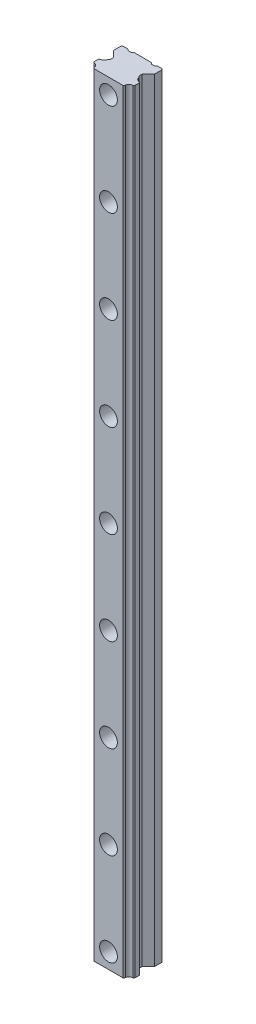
ISO-10303-21;
HEADER;
FILE_DESCRIPTION(('STEP AP214'),'2;1');
FILE_NAME('part.step','',(''),(''),'','','');
FILE_SCHEMA(('AUTOMOTIVE_DESIGN { 1 0 10303 214 1 1 1 1 }'));
ENDSEC;
DATA;
#1=APPLICATION_CONTEXT('core data for automotive mechanical design processes');
#2=APPLICATION_PROTOCOL_DEFINITION('international standard','automotive_design',2000,#1);
#3=PRODUCT_CONTEXT('',#1,'mechanical');
#4=PRODUCT('Part','Part','',(#3));
#5=PRODUCT_RELATED_PRODUCT_CATEGORY('part','',(#4));
#6=PRODUCT_DEFINITION_FORMATION('','',#4);
#7=PRODUCT_DEFINITION_CONTEXT('part definition',#1,'design');
#8=PRODUCT_DEFINITION('design','',#6,#7);
#9=PRODUCT_DEFINITION_SHAPE('','',#8);
#10=(LENGTH_UNIT() NAMED_UNIT(*) SI_UNIT(.MILLI.,.METRE.));
#11=(NAMED_UNIT(*) PLANE_ANGLE_UNIT() SI_UNIT($,.RADIAN.));
#12=(NAMED_UNIT(*) SI_UNIT($,.STERADIAN.) SOLID_ANGLE_UNIT());
#13=UNCERTAINTY_MEASURE_WITH_UNIT(LENGTH_MEASURE(1.E-05),#10,'distance_accuracy_value','');
#14=(GEOMETRIC_REPRESENTATION_CONTEXT(3) GLOBAL_UNCERTAINTY_ASSIGNED_CONTEXT((#13)) GLOBAL_UNIT_ASSIGNED_CONTEXT((#10,
#11,#12)) REPRESENTATION_CONTEXT('',''));
#15=CARTESIAN_POINT('',(0.,0.,0.));
#16=DIRECTION('',(0.,0.,1.));
#17=DIRECTION('',(1.,0.,0.));
#18=AXIS2_PLACEMENT_3D('',#15,#16,#17);
#19=CARTESIAN_POINT('',(0.,980.,-20.));
#20=DIRECTION('',(0.,0.,-1.));
#21=DIRECTION('',(0.,-1.,0.));
#22=AXIS2_PLACEMENT_3D('',#19,#20,#21);
#23=PLANE('',#22);
#24=CARTESIAN_POINT('',(0.,980.,-20.));
#25=DIRECTION('',(0.,0.,-1.));
#26=DIRECTION('',(0.,-1.,0.));
#27=AXIS2_PLACEMENT_3D('',#24,#25,#26);
#28=CIRCLE('',#27,8.);
#29=CARTESIAN_POINT('',(0.,972.,-20.));
#30=VERTEX_POINT('',#29);
#31=EDGE_CURVE('E10',#30,#30,#28,.T.);
#32=ORIENTED_EDGE('',*,*,#31,.T.);
#33=EDGE_LOOP('',(#32));
#34=FACE_BOUND('',#33,.T.);
#35=CARTESIAN_POINT('',(0.,980.,-20.));
#36=DIRECTION('',(0.,0.,1.));
#37=DIRECTION('',(0.,-1.,0.));
#38=AXIS2_PLACEMENT_3D('',#35,#36,#37);
#39=CIRCLE('',#38,11.5);
#40=CARTESIAN_POINT('',(0.,968.5,-20.));
#41=VERTEX_POINT('',#40);
#42=EDGE_CURVE('E26',#41,#41,#39,.T.);
#43=ORIENTED_EDGE('',*,*,#42,.T.);
#44=EDGE_LOOP('',(#43));
#45=FACE_BOUND('',#44,.T.);
#46=ADVANCED_FACE('F15',(#34,#45),#23,.F.);
#47=CARTESIAN_POINT('',(0.,980.,0.));
#48=DIRECTION('',(0.,0.,-1.));
#49=DIRECTION('',(0.,-1.,0.));
#50=AXIS2_PLACEMENT_3D('',#47,#48,#49);
#51=CYLINDRICAL_SURFACE('',#50,11.5);
#52=ORIENTED_EDGE('',*,*,#42,.F.);
#53=EDGE_LOOP('',(#52));
#54=FACE_BOUND('',#53,.T.);
#55=CARTESIAN_POINT('',(0.,980.,0.));
#56=DIRECTION('',(0.,0.,-1.));
#57=DIRECTION('',(0.,-1.,0.));
#58=AXIS2_PLACEMENT_3D('',#55,#56,#57);
#59=CIRCLE('',#58,11.5);
#60=CARTESIAN_POINT('',(0.,968.5,0.));
#61=VERTEX_POINT('',#60);
#62=EDGE_CURVE('E462',#61,#61,#59,.T.);
#63=ORIENTED_EDGE('',*,*,#62,.F.);
#64=EDGE_LOOP('',(#63));
#65=FACE_BOUND('',#64,.T.);
#66=ADVANCED_FACE('F1225',(#54,#65),#51,.F.);
#67=CARTESIAN_POINT('',(0.,980.,-20.));
#68=DIRECTION('',(0.,0.,-1.));
#69=DIRECTION('',(0.,-1.,0.));
#70=AXIS2_PLACEMENT_3D('',#67,#68,#69);
#71=CYLINDRICAL_SURFACE('',#70,8.);
#72=CARTESIAN_POINT('',(0.,980.,-44.0000000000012));
#73=DIRECTION('',(0.,0.,-1.));
#74=DIRECTION('',(-1.,0.,0.));
#75=AXIS2_PLACEMENT_3D('',#72,#73,#74);
#76=CIRCLE('',#75,8.);
#77=CARTESIAN_POINT('',(-8.,980.,-44.0000000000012));
#78=VERTEX_POINT('',#77);
#79=EDGE_CURVE('E761',#78,#78,#76,.T.);
#80=ORIENTED_EDGE('',*,*,#79,.T.);
#81=EDGE_LOOP('',(#80));
#82=FACE_BOUND('',#81,.T.);
#83=ORIENTED_EDGE('',*,*,#31,.F.);
#84=EDGE_LOOP('',(#83));
#85=FACE_BOUND('',#84,.T.);
#86=ADVANCED_FACE('F1234',(#82,#85),#71,.F.);
#87=CARTESIAN_POINT('',(0.,860.,-20.));
#88=DIRECTION('',(0.,0.,-1.));
#89=DIRECTION('',(0.,-1.,0.));
#90=AXIS2_PLACEMENT_3D('',#87,#88,#89);
#91=PLANE('',#90);
#92=CARTESIAN_POINT('',(0.,860.,-20.));
#93=DIRECTION('',(0.,0.,-1.));
#94=DIRECTION('',(0.,-1.,0.));
#95=AXIS2_PLACEMENT_3D('',#92,#93,#94);
#96=CIRCLE('',#95,8.);
#97=CARTESIAN_POINT('',(0.,852.,-20.));
#98=VERTEX_POINT('',#97);
#99=EDGE_CURVE('E765',#98,#98,#96,.T.);
#100=ORIENTED_EDGE('',*,*,#99,.T.);
#101=EDGE_LOOP('',(#100));
#102=FACE_BOUND('',#101,.T.);
#103=CARTESIAN_POINT('',(0.,860.,-20.));
#104=DIRECTION('',(0.,0.,1.));
#105=DIRECTION('',(0.,-1.,0.));
#106=AXIS2_PLACEMENT_3D('',#103,#104,#105);
#107=CIRCLE('',#106,11.5);
#108=CARTESIAN_POINT('',(0.,848.5,-20.));
#109=VERTEX_POINT('',#108);
#110=EDGE_CURVE('E804',#109,#109,#107,.T.);
#111=ORIENTED_EDGE('',*,*,#110,.T.);
#112=EDGE_LOOP('',(#111));
#113=FACE_BOUND('',#112,.T.);
#114=ADVANCED_FACE('F17',(#102,#113),#91,.F.);
#115=CARTESIAN_POINT('',(0.,860.,0.));
#116=DIRECTION('',(0.,0.,-1.));
#117=DIRECTION('',(0.,-1.,0.));
#118=AXIS2_PLACEMENT_3D('',#115,#116,#117);
#119=CYLINDRICAL_SURFACE('',#118,11.5);
#120=ORIENTED_EDGE('',*,*,#110,.F.);
#121=EDGE_LOOP('',(#120));
#122=FACE_BOUND('',#121,.T.);
#123=CARTESIAN_POINT('',(0.,860.,0.));
#124=DIRECTION('',(0.,0.,-1.));
#125=DIRECTION('',(0.,-1.,0.));
#126=AXIS2_PLACEMENT_3D('',#123,#124,#125);
#127=CIRCLE('',#126,11.5);
#128=CARTESIAN_POINT('',(0.,848.5,0.));
#129=VERTEX_POINT('',#128);
#130=EDGE_CURVE('E580',#129,#129,#127,.T.);
#131=ORIENTED_EDGE('',*,*,#130,.F.);
#132=EDGE_LOOP('',(#131));
#133=FACE_BOUND('',#132,.T.);
#134=ADVANCED_FACE('F1477',(#122,#133),#119,.F.);
#135=CARTESIAN_POINT('',(0.,860.,-20.));
#136=DIRECTION('',(0.,0.,-1.));
#137=DIRECTION('',(0.,-1.,0.));
#138=AXIS2_PLACEMENT_3D('',#135,#136,#137);
#139=CYLINDRICAL_SURFACE('',#138,8.);
#140=CARTESIAN_POINT('',(0.,860.,-44.0000000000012));
#141=DIRECTION('',(0.,0.,-1.));
#142=DIRECTION('',(-1.,0.,0.));
#143=AXIS2_PLACEMENT_3D('',#140,#141,#142);
#144=CIRCLE('',#143,8.);
#145=CARTESIAN_POINT('',(-8.,860.,-44.0000000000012));
#146=VERTEX_POINT('',#145);
#147=EDGE_CURVE('E810',#146,#146,#144,.T.);
#148=ORIENTED_EDGE('',*,*,#147,.T.);
#149=EDGE_LOOP('',(#148));
#150=FACE_BOUND('',#149,.T.);
#151=ORIENTED_EDGE('',*,*,#99,.F.);
#152=EDGE_LOOP('',(#151));
#153=FACE_BOUND('',#152,.T.);
#154=ADVANCED_FACE('F1181',(#150,#153),#139,.F.);
#155=CARTESIAN_POINT('',(0.,740.,-20.));
#156=DIRECTION('',(0.,0.,-1.));
#157=DIRECTION('',(0.,-1.,0.));
#158=AXIS2_PLACEMENT_3D('',#155,#156,#157);
#159=PLANE('',#158);
#160=CARTESIAN_POINT('',(0.,740.,-20.));
#161=DIRECTION('',(0.,0.,-1.));
#162=DIRECTION('',(0.,-1.,0.));
#163=AXIS2_PLACEMENT_3D('',#160,#161,#162);
#164=CIRCLE('',#163,8.);
#165=CARTESIAN_POINT('',(0.,732.,-20.));
#166=VERTEX_POINT('',#165);
#167=EDGE_CURVE('E748',#166,#166,#164,.T.);
#168=ORIENTED_EDGE('',*,*,#167,.T.);
#169=EDGE_LOOP('',(#168));
#170=FACE_BOUND('',#169,.T.);
#171=CARTESIAN_POINT('',(0.,740.,-20.));
#172=DIRECTION('',(0.,0.,1.));
#173=DIRECTION('',(0.,-1.,0.));
#174=AXIS2_PLACEMENT_3D('',#171,#172,#173);
#175=CIRCLE('',#174,11.5);
#176=CARTESIAN_POINT('',(0.,728.5,-20.));
#177=VERTEX_POINT('',#176);
#178=EDGE_CURVE('E744',#177,#177,#175,.T.);
#179=ORIENTED_EDGE('',*,*,#178,.T.);
#180=EDGE_LOOP('',(#179));
#181=FACE_BOUND('',#180,.T.);
#182=ADVANCED_FACE('F1175',(#170,#181),#159,.F.);
#183=CARTESIAN_POINT('',(0.,740.,0.));
#184=DIRECTION('',(0.,0.,-1.));
#185=DIRECTION('',(0.,-1.,0.));
#186=AXIS2_PLACEMENT_3D('',#183,#184,#185);
#187=CYLINDRICAL_SURFACE('',#186,11.5);
#188=ORIENTED_EDGE('',*,*,#178,.F.);
#189=EDGE_LOOP('',(#188));
#190=FACE_BOUND('',#189,.T.);
#191=CARTESIAN_POINT('',(0.,740.,0.));
#192=DIRECTION('',(0.,0.,-1.));
#193=DIRECTION('',(0.,-1.,0.));
#194=AXIS2_PLACEMENT_3D('',#191,#192,#193);
#195=CIRCLE('',#194,11.5);
#196=CARTESIAN_POINT('',(0.,728.5,0.));
#197=VERTEX_POINT('',#196);
#198=EDGE_CURVE('E798',#197,#197,#195,.T.);
#199=ORIENTED_EDGE('',*,*,#198,.F.);
#200=EDGE_LOOP('',(#199));
#201=FACE_BOUND('',#200,.T.);
#202=ADVANCED_FACE('F1180',(#190,#201),#187,.F.);
#203=CARTESIAN_POINT('',(0.,740.,-20.));
#204=DIRECTION('',(0.,0.,-1.));
#205=DIRECTION('',(0.,-1.,0.));
#206=AXIS2_PLACEMENT_3D('',#203,#204,#205);
#207=CYLINDRICAL_SURFACE('',#206,8.);
#208=CARTESIAN_POINT('',(0.,740.,-44.0000000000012));
#209=DIRECTION('',(0.,0.,-1.));
#210=DIRECTION('',(-1.,0.,0.));
#211=AXIS2_PLACEMENT_3D('',#208,#209,#210);
#212=CIRCLE('',#211,8.);
#213=CARTESIAN_POINT('',(-8.,740.,-44.0000000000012));
#214=VERTEX_POINT('',#213);
#215=EDGE_CURVE('E479',#214,#214,#212,.T.);
#216=ORIENTED_EDGE('',*,*,#215,.T.);
#217=EDGE_LOOP('',(#216));
#218=FACE_BOUND('',#217,.T.);
#219=ORIENTED_EDGE('',*,*,#167,.F.);
#220=EDGE_LOOP('',(#219));
#221=FACE_BOUND('',#220,.T.);
#222=ADVANCED_FACE('F1334',(#218,#221),#207,.F.);
#223=CARTESIAN_POINT('',(0.,620.,-20.));
#224=DIRECTION('',(0.,0.,-1.));
#225=DIRECTION('',(0.,-1.,0.));
#226=AXIS2_PLACEMENT_3D('',#223,#224,#225);
#227=PLANE('',#226);
#228=CARTESIAN_POINT('',(0.,620.,-20.));
#229=DIRECTION('',(0.,0.,-1.));
#230=DIRECTION('',(0.,-1.,0.));
#231=AXIS2_PLACEMENT_3D('',#228,#229,#230);
#232=CIRCLE('',#231,8.);
#233=CARTESIAN_POINT('',(0.,612.,-20.));
#234=VERTEX_POINT('',#233);
#235=EDGE_CURVE('E475',#234,#234,#232,.T.);
#236=ORIENTED_EDGE('',*,*,#235,.T.);
#237=EDGE_LOOP('',(#236));
#238=FACE_BOUND('',#237,.T.);
#239=CARTESIAN_POINT('',(0.,620.,-20.));
#240=DIRECTION('',(0.,0.,1.));
#241=DIRECTION('',(0.,-1.,0.));
#242=AXIS2_PLACEMENT_3D('',#239,#240,#241);
#243=CIRCLE('',#242,11.5);
#244=CARTESIAN_POINT('',(0.,608.5,-20.));
#245=VERTEX_POINT('',#244);
#246=EDGE_CURVE('E467',#245,#245,#243,.T.);
#247=ORIENTED_EDGE('',*,*,#246,.T.);
#248=EDGE_LOOP('',(#247));
#249=FACE_BOUND('',#248,.T.);
#250=ADVANCED_FACE('F1206',(#238,#249),#227,.F.);
#251=CARTESIAN_POINT('',(0.,620.,0.));
#252=DIRECTION('',(0.,0.,-1.));
#253=DIRECTION('',(0.,-1.,0.));
#254=AXIS2_PLACEMENT_3D('',#251,#252,#253);
#255=CYLINDRICAL_SURFACE('',#254,11.5);
#256=ORIENTED_EDGE('',*,*,#246,.F.);
#257=EDGE_LOOP('',(#256));
#258=FACE_BOUND('',#257,.T.);
#259=CARTESIAN_POINT('',(0.,620.,0.));
#260=DIRECTION('',(0.,0.,-1.));
#261=DIRECTION('',(0.,-1.,0.));
#262=AXIS2_PLACEMENT_3D('',#259,#260,#261);
#263=CIRCLE('',#262,11.5);
#264=CARTESIAN_POINT('',(0.,608.5,0.));
#265=VERTEX_POINT('',#264);
#266=EDGE_CURVE('E794',#265,#265,#263,.T.);
#267=ORIENTED_EDGE('',*,*,#266,.F.);
#268=EDGE_LOOP('',(#267));
#269=FACE_BOUND('',#268,.T.);
#270=ADVANCED_FACE('F1200',(#258,#269),#255,.F.);
#271=CARTESIAN_POINT('',(0.,620.,-20.));
#272=DIRECTION('',(0.,0.,-1.));
#273=DIRECTION('',(0.,-1.,0.));
#274=AXIS2_PLACEMENT_3D('',#271,#272,#273);
#275=CYLINDRICAL_SURFACE('',#274,8.);
#276=CARTESIAN_POINT('',(0.,620.,-44.0000000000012));
#277=DIRECTION('',(0.,0.,-1.));
#278=DIRECTION('',(-1.,0.,0.));
#279=AXIS2_PLACEMENT_3D('',#276,#277,#278);
#280=CIRCLE('',#279,8.);
#281=CARTESIAN_POINT('',(-8.,620.,-44.0000000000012));
#282=VERTEX_POINT('',#281);
#283=EDGE_CURVE('E463',#282,#282,#280,.T.);
#284=ORIENTED_EDGE('',*,*,#283,.T.);
#285=EDGE_LOOP('',(#284));
#286=FACE_BOUND('',#285,.T.);
#287=ORIENTED_EDGE('',*,*,#235,.F.);
#288=EDGE_LOOP('',(#287));
#289=FACE_BOUND('',#288,.T.);
#290=ADVANCED_FACE('F1205',(#286,#289),#275,.F.);
#291=CARTESIAN_POINT('',(0.,500.,-20.));
#292=DIRECTION('',(0.,0.,-1.));
#293=DIRECTION('',(0.,-1.,0.));
#294=AXIS2_PLACEMENT_3D('',#291,#292,#293);
#295=PLANE('',#294);
#296=CARTESIAN_POINT('',(0.,500.,-20.));
#297=DIRECTION('',(0.,0.,-1.));
#298=DIRECTION('',(0.,-1.,0.));
#299=AXIS2_PLACEMENT_3D('',#296,#297,#298);
#300=CIRCLE('',#299,8.);
#301=CARTESIAN_POINT('',(0.,492.,-20.));
#302=VERTEX_POINT('',#301);
#303=EDGE_CURVE('E468',#302,#302,#300,.T.);
#304=ORIENTED_EDGE('',*,*,#303,.T.);
#305=EDGE_LOOP('',(#304));
#306=FACE_BOUND('',#305,.T.);
#307=CARTESIAN_POINT('',(0.,500.,-20.));
#308=DIRECTION('',(0.,0.,1.));
#309=DIRECTION('',(0.,-1.,0.));
#310=AXIS2_PLACEMENT_3D('',#307,#308,#309);
#311=CIRCLE('',#310,11.5);
#312=CARTESIAN_POINT('',(0.,488.5,-20.));
#313=VERTEX_POINT('',#312);
#314=EDGE_CURVE('E629',#313,#313,#311,.T.);
#315=ORIENTED_EDGE('',*,*,#314,.T.);
#316=EDGE_LOOP('',(#315));
#317=FACE_BOUND('',#316,.T.);
#318=ADVANCED_FACE('F1378',(#306,#317),#295,.F.);
#319=CARTESIAN_POINT('',(0.,500.,0.));
#320=DIRECTION('',(0.,0.,-1.));
#321=DIRECTION('',(0.,-1.,0.));
#322=AXIS2_PLACEMENT_3D('',#319,#320,#321);
#323=CYLINDRICAL_SURFACE('',#322,11.5);
#324=ORIENTED_EDGE('',*,*,#314,.F.);
#325=EDGE_LOOP('',(#324));
#326=FACE_BOUND('',#325,.T.);
#327=CARTESIAN_POINT('',(0.,500.,0.));
#328=DIRECTION('',(0.,0.,-1.));
#329=DIRECTION('',(0.,-1.,0.));
#330=AXIS2_PLACEMENT_3D('',#327,#328,#329);
#331=CIRCLE('',#330,11.5);
#332=CARTESIAN_POINT('',(0.,488.5,0.));
#333=VERTEX_POINT('',#332);
#334=EDGE_CURVE('E799',#333,#333,#331,.T.);
#335=ORIENTED_EDGE('',*,*,#334,.F.);
#336=EDGE_LOOP('',(#335));
#337=FACE_BOUND('',#336,.T.);
#338=ADVANCED_FACE('F1316',(#326,#337),#323,.F.);
#339=CARTESIAN_POINT('',(0.,500.,-20.));
#340=DIRECTION('',(0.,0.,-1.));
#341=DIRECTION('',(0.,-1.,0.));
#342=AXIS2_PLACEMENT_3D('',#339,#340,#341);
#343=CYLINDRICAL_SURFACE('',#342,8.);
#344=CARTESIAN_POINT('',(0.,500.,-44.0000000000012));
#345=DIRECTION('',(0.,0.,-1.));
#346=DIRECTION('',(-1.,0.,0.));
#347=AXIS2_PLACEMENT_3D('',#344,#345,#346);
#348=CIRCLE('',#347,8.);
#349=CARTESIAN_POINT('',(-8.,500.,-44.0000000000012));
#350=VERTEX_POINT('',#349);
#351=EDGE_CURVE('E706',#350,#350,#348,.T.);
#352=ORIENTED_EDGE('',*,*,#351,.T.);
#353=EDGE_LOOP('',(#352));
#354=FACE_BOUND('',#353,.T.);
#355=ORIENTED_EDGE('',*,*,#303,.F.);
#356=EDGE_LOOP('',(#355));
#357=FACE_BOUND('',#356,.T.);
#358=ADVANCED_FACE('F1310',(#354,#357),#343,.F.);
#359=CARTESIAN_POINT('',(0.,380.,-20.));
#360=DIRECTION('',(0.,0.,-1.));
#361=DIRECTION('',(0.,-1.,0.));
#362=AXIS2_PLACEMENT_3D('',#359,#360,#361);
#363=PLANE('',#362);
#364=CARTESIAN_POINT('',(0.,380.,-20.));
#365=DIRECTION('',(0.,0.,-1.));
#366=DIRECTION('',(0.,-1.,0.));
#367=AXIS2_PLACEMENT_3D('',#364,#365,#366);
#368=CIRCLE('',#367,8.);
#369=CARTESIAN_POINT('',(0.,372.,-20.));
#370=VERTEX_POINT('',#369);
#371=EDGE_CURVE('E519',#370,#370,#368,.T.);
#372=ORIENTED_EDGE('',*,*,#371,.T.);
#373=EDGE_LOOP('',(#372));
#374=FACE_BOUND('',#373,.T.);
#375=CARTESIAN_POINT('',(0.,380.,-20.));
#376=DIRECTION('',(0.,0.,1.));
#377=DIRECTION('',(0.,-1.,0.));
#378=AXIS2_PLACEMENT_3D('',#375,#376,#377);
#379=CIRCLE('',#378,11.5);
#380=CARTESIAN_POINT('',(0.,368.5,-20.));
#381=VERTEX_POINT('',#380);
#382=EDGE_CURVE('E511',#381,#381,#379,.T.);
#383=ORIENTED_EDGE('',*,*,#382,.T.);
#384=EDGE_LOOP('',(#383));
#385=FACE_BOUND('',#384,.T.);
#386=ADVANCED_FACE('F1315',(#374,#385),#363,.F.);
#387=CARTESIAN_POINT('',(0.,380.,0.));
#388=DIRECTION('',(0.,0.,-1.));
#389=DIRECTION('',(0.,-1.,0.));
#390=AXIS2_PLACEMENT_3D('',#387,#388,#389);
#391=CYLINDRICAL_SURFACE('',#390,11.5);
#392=ORIENTED_EDGE('',*,*,#382,.F.);
#393=EDGE_LOOP('',(#392));
#394=FACE_BOUND('',#393,.T.);
#395=CARTESIAN_POINT('',(0.,380.,0.));
#396=DIRECTION('',(0.,0.,-1.));
#397=DIRECTION('',(0.,-1.,0.));
#398=AXIS2_PLACEMENT_3D('',#395,#396,#397);
#399=CIRCLE('',#398,11.5);
#400=CARTESIAN_POINT('',(0.,368.5,0.));
#401=VERTEX_POINT('',#400);
#402=EDGE_CURVE('E719',#401,#401,#399,.T.);
#403=ORIENTED_EDGE('',*,*,#402,.F.);
#404=EDGE_LOOP('',(#403));
#405=FACE_BOUND('',#404,.T.);
#406=ADVANCED_FACE('F1362',(#394,#405),#391,.F.);
#407=CARTESIAN_POINT('',(0.,380.,-20.));
#408=DIRECTION('',(0.,0.,-1.));
#409=DIRECTION('',(0.,-1.,0.));
#410=AXIS2_PLACEMENT_3D('',#407,#408,#409);
#411=CYLINDRICAL_SURFACE('',#410,8.);
#412=CARTESIAN_POINT('',(0.,380.,-44.0000000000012));
#413=DIRECTION('',(0.,0.,-1.));
#414=DIRECTION('',(-1.,0.,0.));
#415=AXIS2_PLACEMENT_3D('',#412,#413,#414);
#416=CIRCLE('',#415,8.);
#417=CARTESIAN_POINT('',(-8.,380.,-44.0000000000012));
#418=VERTEX_POINT('',#417);
#419=EDGE_CURVE('E508',#418,#418,#416,.T.);
#420=ORIENTED_EDGE('',*,*,#419,.T.);
#421=EDGE_LOOP('',(#420));
#422=FACE_BOUND('',#421,.T.);
#423=ORIENTED_EDGE('',*,*,#371,.F.);
#424=EDGE_LOOP('',(#423));
#425=FACE_BOUND('',#424,.T.);
#426=ADVANCED_FACE('F1632',(#422,#425),#411,.F.);
#427=CARTESIAN_POINT('',(0.,260.,-20.));
#428=DIRECTION('',(0.,0.,-1.));
#429=DIRECTION('',(0.,-1.,0.));
#430=AXIS2_PLACEMENT_3D('',#427,#428,#429);
#431=PLANE('',#430);
#432=CARTESIAN_POINT('',(0.,260.,-20.));
#433=DIRECTION('',(0.,0.,-1.));
#434=DIRECTION('',(0.,-1.,0.));
#435=AXIS2_PLACEMENT_3D('',#432,#433,#434);
#436=CIRCLE('',#435,8.);
#437=CARTESIAN_POINT('',(0.,252.,-20.));
#438=VERTEX_POINT('',#437);
#439=EDGE_CURVE('E512',#438,#438,#436,.T.);
#440=ORIENTED_EDGE('',*,*,#439,.T.);
#441=EDGE_LOOP('',(#440));
#442=FACE_BOUND('',#441,.T.);
#443=CARTESIAN_POINT('',(0.,260.,-20.));
#444=DIRECTION('',(0.,0.,1.));
#445=DIRECTION('',(0.,-1.,0.));
#446=AXIS2_PLACEMENT_3D('',#443,#444,#445);
#447=CIRCLE('',#446,11.5);
#448=CARTESIAN_POINT('',(0.,248.5,-20.));
#449=VERTEX_POINT('',#448);
#450=EDGE_CURVE('E522',#449,#449,#447,.T.);
#451=ORIENTED_EDGE('',*,*,#450,.T.);
#452=EDGE_LOOP('',(#451));
#453=FACE_BOUND('',#452,.T.);
#454=ADVANCED_FACE('F1550',(#442,#453),#431,.F.);
#455=CARTESIAN_POINT('',(0.,260.,0.));
#456=DIRECTION('',(0.,0.,-1.));
#457=DIRECTION('',(0.,-1.,0.));
#458=AXIS2_PLACEMENT_3D('',#455,#456,#457);
#459=CYLINDRICAL_SURFACE('',#458,11.5);
#460=ORIENTED_EDGE('',*,*,#450,.F.);
#461=EDGE_LOOP('',(#460));
#462=FACE_BOUND('',#461,.T.);
#463=CARTESIAN_POINT('',(0.,260.,0.));
#464=DIRECTION('',(0.,0.,-1.));
#465=DIRECTION('',(0.,-1.,0.));
#466=AXIS2_PLACEMENT_3D('',#463,#464,#465);
#467=CIRCLE('',#466,11.5);
#468=CARTESIAN_POINT('',(0.,248.5,0.));
#469=VERTEX_POINT('',#468);
#470=EDGE_CURVE('E715',#469,#469,#467,.T.);
#471=ORIENTED_EDGE('',*,*,#470,.F.);
#472=EDGE_LOOP('',(#471));
#473=FACE_BOUND('',#472,.T.);
#474=ADVANCED_FACE('F1246',(#462,#473),#459,.F.);
#475=CARTESIAN_POINT('',(0.,260.,-20.));
#476=DIRECTION('',(0.,0.,-1.));
#477=DIRECTION('',(0.,-1.,0.));
#478=AXIS2_PLACEMENT_3D('',#475,#476,#477);
#479=CYLINDRICAL_SURFACE('',#478,8.);
#480=CARTESIAN_POINT('',(0.,260.,-44.0000000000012));
#481=DIRECTION('',(0.,0.,-1.));
#482=DIRECTION('',(-1.,0.,0.));
#483=AXIS2_PLACEMENT_3D('',#480,#481,#482);
#484=CIRCLE('',#483,8.);
#485=CARTESIAN_POINT('',(-8.,260.,-44.0000000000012));
#486=VERTEX_POINT('',#485);
#487=EDGE_CURVE('E530',#486,#486,#484,.T.);
#488=ORIENTED_EDGE('',*,*,#487,.T.);
#489=EDGE_LOOP('',(#488));
#490=FACE_BOUND('',#489,.T.);
#491=ORIENTED_EDGE('',*,*,#439,.F.);
#492=EDGE_LOOP('',(#491));
#493=FACE_BOUND('',#492,.T.);
#494=ADVANCED_FACE('F1240',(#490,#493),#479,.F.);
#495=CARTESIAN_POINT('',(0.,140.,-20.));
#496=DIRECTION('',(0.,0.,-1.));
#497=DIRECTION('',(0.,-1.,0.));
#498=AXIS2_PLACEMENT_3D('',#495,#496,#497);
#499=PLANE('',#498);
#500=CARTESIAN_POINT('',(0.,140.,-20.));
#501=DIRECTION('',(0.,0.,-1.));
#502=DIRECTION('',(0.,-1.,0.));
#503=AXIS2_PLACEMENT_3D('',#500,#501,#502);
#504=CIRCLE('',#503,8.);
#505=CARTESIAN_POINT('',(0.,132.,-20.));
#506=VERTEX_POINT('',#505);
#507=EDGE_CURVE('E729',#506,#506,#504,.T.);
#508=ORIENTED_EDGE('',*,*,#507,.T.);
#509=EDGE_LOOP('',(#508));
#510=FACE_BOUND('',#509,.T.);
#511=CARTESIAN_POINT('',(0.,140.,-20.));
#512=DIRECTION('',(0.,0.,1.));
#513=DIRECTION('',(0.,-1.,0.));
#514=AXIS2_PLACEMENT_3D('',#511,#512,#513);
#515=CIRCLE('',#514,11.5);
#516=CARTESIAN_POINT('',(0.,128.5,-20.));
#517=VERTEX_POINT('',#516);
#518=EDGE_CURVE('E461',#517,#517,#515,.T.);
#519=ORIENTED_EDGE('',*,*,#518,.T.);
#520=EDGE_LOOP('',(#519));
#521=FACE_BOUND('',#520,.T.);
#522=ADVANCED_FACE('F1245',(#510,#521),#499,.F.);
#523=CARTESIAN_POINT('',(0.,140.,0.));
#524=DIRECTION('',(0.,0.,-1.));
#525=DIRECTION('',(0.,-1.,0.));
#526=AXIS2_PLACEMENT_3D('',#523,#524,#525);
#527=CYLINDRICAL_SURFACE('',#526,11.5);
#528=ORIENTED_EDGE('',*,*,#518,.F.);
#529=EDGE_LOOP('',(#528));
#530=FACE_BOUND('',#529,.T.);
#531=CARTESIAN_POINT('',(0.,140.,0.));
#532=DIRECTION('',(0.,0.,-1.));
#533=DIRECTION('',(0.,-1.,0.));
#534=AXIS2_PLACEMENT_3D('',#531,#532,#533);
#535=CIRCLE('',#534,11.5);
#536=CARTESIAN_POINT('',(0.,128.5,0.));
#537=VERTEX_POINT('',#536);
#538=EDGE_CURVE('E720',#537,#537,#535,.T.);
#539=ORIENTED_EDGE('',*,*,#538,.F.);
#540=EDGE_LOOP('',(#539));
#541=FACE_BOUND('',#540,.T.);
#542=ADVANCED_FACE('F1418',(#530,#541),#527,.F.);
#543=CARTESIAN_POINT('',(0.,140.,-20.));
#544=DIRECTION('',(0.,0.,-1.));
#545=DIRECTION('',(0.,-1.,0.));
#546=AXIS2_PLACEMENT_3D('',#543,#544,#545);
#547=CYLINDRICAL_SURFACE('',#546,8.);
#548=CARTESIAN_POINT('',(0.,140.,-44.0000000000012));
#549=DIRECTION('',(0.,0.,-1.));
#550=DIRECTION('',(-1.,0.,0.));
#551=AXIS2_PLACEMENT_3D('',#548,#549,#550);
#552=CIRCLE('',#551,8.);
#553=CARTESIAN_POINT('',(-8.,140.,-44.0000000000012));
#554=VERTEX_POINT('',#553);
#555=EDGE_CURVE('E457',#554,#554,#552,.T.);
#556=ORIENTED_EDGE('',*,*,#555,.T.);
#557=EDGE_LOOP('',(#556));
#558=FACE_BOUND('',#557,.T.);
#559=ORIENTED_EDGE('',*,*,#507,.F.);
#560=EDGE_LOOP('',(#559));
#561=FACE_BOUND('',#560,.T.);
#562=ADVANCED_FACE('F1257',(#558,#561),#547,.F.);
#563=CARTESIAN_POINT('',(-32.5,1000.,0.));
#564=DIRECTION('',(0.,0.,-1.));
#565=DIRECTION('',(0.,-1.,0.));
#566=AXIS2_PLACEMENT_3D('',#563,#564,#565);
#567=PLANE('',#566);
#568=ORIENTED_EDGE('',*,*,#62,.T.);
#569=EDGE_LOOP('',(#568));
#570=FACE_BOUND('',#569,.T.);
#571=ORIENTED_EDGE('',*,*,#130,.T.);
#572=EDGE_LOOP('',(#571));
#573=FACE_BOUND('',#572,.T.);
#574=ORIENTED_EDGE('',*,*,#198,.T.);
#575=EDGE_LOOP('',(#574));
#576=FACE_BOUND('',#575,.T.);
#577=ORIENTED_EDGE('',*,*,#266,.T.);
#578=EDGE_LOOP('',(#577));
#579=FACE_BOUND('',#578,.T.);
#580=ORIENTED_EDGE('',*,*,#334,.T.);
#581=EDGE_LOOP('',(#580));
#582=FACE_BOUND('',#581,.T.);
#583=ORIENTED_EDGE('',*,*,#402,.T.);
#584=EDGE_LOOP('',(#583));
#585=FACE_BOUND('',#584,.T.);
#586=ORIENTED_EDGE('',*,*,#470,.T.);
#587=EDGE_LOOP('',(#586));
#588=FACE_BOUND('',#587,.T.);
#589=ORIENTED_EDGE('',*,*,#538,.T.);
#590=EDGE_LOOP('',(#589));
#591=FACE_BOUND('',#590,.T.);
#592=CARTESIAN_POINT('',(0.,20.,0.));
#593=DIRECTION('',(0.,0.,-1.));
#594=DIRECTION('',(0.,-1.,0.));
#595=AXIS2_PLACEMENT_3D('',#592,#593,#594);
#596=CIRCLE('',#595,11.5);
#597=CARTESIAN_POINT('',(0.,8.5,0.));
#598=VERTEX_POINT('',#597);
#599=EDGE_CURVE('E777',#598,#598,#596,.T.);
#600=ORIENTED_EDGE('',*,*,#599,.T.);
#601=EDGE_LOOP('',(#600));
#602=FACE_BOUND('',#601,.T.);
#603=DIRECTION('',(0.,-1.,0.));
#604=VECTOR('',#603,1.);
#605=CARTESIAN_POINT('',(-18.9919942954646,1003.61845339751,0.));
#606=LINE('',#605,#604);
#607=CARTESIAN_POINT('',(-18.9919942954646,1000.,0.));
#608=VERTEX_POINT('',#607);
#609=CARTESIAN_POINT('',(-18.9919942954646,0.,0.));
#610=VERTEX_POINT('',#609);
#611=EDGE_CURVE('E484',#608,#610,#606,.T.);
#612=ORIENTED_EDGE('',*,*,#611,.T.);
#613=DIRECTION('',(1.,0.,0.));
#614=VECTOR('',#613,1.);
#615=CARTESIAN_POINT('',(-32.5,0.,0.));
#616=LINE('',#615,#614);
#617=CARTESIAN_POINT('',(18.9919942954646,0.,0.));
#618=VERTEX_POINT('',#617);
#619=EDGE_CURVE('E480',#610,#618,#616,.T.);
#620=ORIENTED_EDGE('',*,*,#619,.T.);
#621=DIRECTION('',(0.,-1.,0.));
#622=VECTOR('',#621,1.);
#623=CARTESIAN_POINT('',(18.9919942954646,1003.61845339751,0.));
#624=LINE('',#623,#622);
#625=CARTESIAN_POINT('',(18.9919942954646,1000.,0.));
#626=VERTEX_POINT('',#625);
#627=EDGE_CURVE('E662',#626,#618,#624,.T.);
#628=ORIENTED_EDGE('',*,*,#627,.F.);
#629=DIRECTION('',(1.,0.,0.));
#630=VECTOR('',#629,1.);
#631=CARTESIAN_POINT('',(-32.5,1000.,0.));
#632=LINE('',#631,#630);
#633=EDGE_CURVE('E549',#608,#626,#632,.T.);
#634=ORIENTED_EDGE('',*,*,#633,.F.);
#635=EDGE_LOOP('',(#612,#620,#628,#634));
#636=FACE_BOUND('',#635,.T.);
#637=ADVANCED_FACE('F996',(#570,#573,#576,#579,#582,#585,#588,#591,#602,#636),#567,.F.);
#638=CARTESIAN_POINT('',(0.,1000.,0.));
#639=DIRECTION('',(0.,1.,0.));
#640=DIRECTION('',(1.,0.,0.));
#641=AXIS2_PLACEMENT_3D('',#638,#639,#640);
#642=PLANE('',#641);
#643=CARTESIAN_POINT('',(-25.33574945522,1000.,-1.16425054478));
#644=DIRECTION('',(0.,-1.,0.));
#645=DIRECTION('',(0.,0.,1.));
#646=AXIS2_PLACEMENT_3D('',#643,#644,#645);
#647=CIRCLE('',#646,5.3);
#648=CARTESIAN_POINT('',(-25.2260466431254,1000.,-6.46311507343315));
#649=VERTEX_POINT('',#648);
#650=CARTESIAN_POINT('',(-20.0620959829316,1000.,-1.6920564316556));
#651=VERTEX_POINT('',#650);
#652=EDGE_CURVE('E485',#649,#651,#647,.T.);
#653=ORIENTED_EDGE('',*,*,#652,.T.);
#654=DIRECTION('',(0.534505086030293,0.,0.845165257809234));
#655=VECTOR('',#654,1.);
#656=CARTESIAN_POINT('',(-13.5660634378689,1000.,8.57954090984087));
#657=LINE('',#656,#655);
#658=EDGE_CURVE('E546',#651,#608,#657,.T.);
#659=ORIENTED_EDGE('',*,*,#658,.T.);
#660=ORIENTED_EDGE('',*,*,#633,.T.);
#661=DIRECTION('',(0.534505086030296,0.,-0.845165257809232));
#662=VECTOR('',#661,1.);
#663=CARTESIAN_POINT('',(13.5660634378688,1000.,8.5795409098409));
#664=LINE('',#663,#662);
#665=CARTESIAN_POINT('',(20.0620959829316,1000.,-1.6920564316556));
#666=VERTEX_POINT('',#665);
#667=EDGE_CURVE('E570',#626,#666,#664,.T.);
#668=ORIENTED_EDGE('',*,*,#667,.T.);
#669=CARTESIAN_POINT('',(25.3357494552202,1000.,-1.1642505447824));
#670=DIRECTION('',(0.,-1.,0.));
#671=DIRECTION('',(0.,0.,1.));
#672=AXIS2_PLACEMENT_3D('',#669,#670,#671);
#673=CIRCLE('',#672,5.3);
#674=CARTESIAN_POINT('',(25.2260466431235,1000.,-6.46311507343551));
#675=VERTEX_POINT('',#674);
#676=EDGE_CURVE('E710',#666,#675,#673,.T.);
#677=ORIENTED_EDGE('',*,*,#676,.T.);
#678=DIRECTION('',(0.707106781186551,0.,-0.707106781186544));
#679=VECTOR('',#678,1.);
#680=CARTESIAN_POINT('',(9.38146578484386,1000.,9.38146578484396));
#681=LINE('',#680,#679);
#682=CARTESIAN_POINT('',(26.4999999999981,1000.,-7.73706843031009));
#683=VERTEX_POINT('',#682);
#684=EDGE_CURVE('E714',#675,#683,#681,.T.);
#685=ORIENTED_EDGE('',*,*,#684,.T.);
#686=DIRECTION('',(0.,0.,-1.));
#687=VECTOR('',#686,1.);
#688=CARTESIAN_POINT('',(26.4999999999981,1000.,0.));
#689=LINE('',#688,#687);
#690=CARTESIAN_POINT('',(26.4999999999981,1000.,-13.4129315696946));
#691=VERTEX_POINT('',#690);
#692=EDGE_CURVE('E694',#683,#691,#689,.T.);
#693=ORIENTED_EDGE('',*,*,#692,.T.);
#694=DIRECTION('',(-0.70710678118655,0.,-0.707106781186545));
#695=VECTOR('',#694,1.);
#696=CARTESIAN_POINT('',(19.9564657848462,1000.,-19.9564657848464));
#697=LINE('',#696,#695);
#698=CARTESIAN_POINT('',(25.2260466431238,1000.,-14.6868849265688));
#699=VERTEX_POINT('',#698);
#700=EDGE_CURVE('E690',#691,#699,#697,.T.);
#701=ORIENTED_EDGE('',*,*,#700,.T.);
#702=CARTESIAN_POINT('',(25.3357494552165,1000.,-19.9857494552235));
#703=DIRECTION('',(0.,-1.,0.));
#704=DIRECTION('',(0.,0.,1.));
#705=AXIS2_PLACEMENT_3D('',#702,#703,#704);
#706=CIRCLE('',#705,5.30000000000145);
#707=CARTESIAN_POINT('',(20.0461519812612,1000.,-19.6538480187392));
#708=VERTEX_POINT('',#707);
#709=EDGE_CURVE('E695',#699,#708,#706,.T.);
#710=ORIENTED_EDGE('',*,*,#709,.T.);
#711=DIRECTION('',(-0.707106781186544,0.,-0.707106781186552));
#712=VECTOR('',#711,1.);
#713=CARTESIAN_POINT('',(19.8500000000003,1000.,-19.85));
#714=LINE('',#713,#712);
#715=CARTESIAN_POINT('',(18.5499999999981,1000.,-21.1500000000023));
#716=VERTEX_POINT('',#715);
#717=EDGE_CURVE('E752',#708,#716,#714,.T.);
#718=ORIENTED_EDGE('',*,*,#717,.T.);
#719=DIRECTION('',(0.,0.,-1.));
#720=VECTOR('',#719,1.);
#721=CARTESIAN_POINT('',(18.5499999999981,1000.,0.));
#722=LINE('',#721,#720);
#723=CARTESIAN_POINT('',(18.5499999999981,1000.,-25.0500000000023));
#724=VERTEX_POINT('',#723);
#725=EDGE_CURVE('E743',#716,#724,#722,.T.);
#726=ORIENTED_EDGE('',*,*,#725,.T.);
#727=DIRECTION('',(0.707106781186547,0.,-0.707106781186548));
#728=VECTOR('',#727,1.);
#729=CARTESIAN_POINT('',(-3.25000000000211,1000.,-3.2500000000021));
#730=LINE('',#729,#728);
#731=CARTESIAN_POINT('',(26.4999999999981,1000.,-33.0000000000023));
#732=VERTEX_POINT('',#731);
#733=EDGE_CURVE('E739',#724,#732,#730,.T.);
#734=ORIENTED_EDGE('',*,*,#733,.T.);
#735=DIRECTION('',(0.,0.,-1.));
#736=VECTOR('',#735,1.);
#737=CARTESIAN_POINT('',(26.4999999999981,1000.,0.));
#738=LINE('',#737,#736);
#739=CARTESIAN_POINT('',(26.4999999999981,1000.,-43.0000000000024));
#740=VERTEX_POINT('',#739);
#741=EDGE_CURVE('E622',#732,#740,#738,.T.);
#742=ORIENTED_EDGE('',*,*,#741,.T.);
#743=DIRECTION('',(-0.707106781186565,0.,-0.70710678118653));
#744=VECTOR('',#743,1.);
#745=CARTESIAN_POINT('',(34.7499999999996,1000.,-34.7500000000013));
#746=LINE('',#745,#744);
#747=CARTESIAN_POINT('',(25.4999999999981,1000.,-44.0000000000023));
#748=VERTEX_POINT('',#747);
#749=EDGE_CURVE('E618',#740,#748,#746,.T.);
#750=ORIENTED_EDGE('',*,*,#749,.T.);
#751=DIRECTION('',(-1.,0.,0.));
#752=VECTOR('',#751,1.);
#753=CARTESIAN_POINT('',(0.,1000.,-44.0000000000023));
#754=LINE('',#753,#752);
#755=CARTESIAN_POINT('',(18.9285714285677,1000.,-44.0000000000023));
#756=VERTEX_POINT('',#755);
#757=EDGE_CURVE('E623',#748,#756,#754,.T.);
#758=ORIENTED_EDGE('',*,*,#757,.T.);
#759=DIRECTION('',(-0.707106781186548,0.,0.707106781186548));
#760=VECTOR('',#759,1.);
#761=CARTESIAN_POINT('',(-12.5357142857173,1000.,-12.5357142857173));
#762=LINE('',#761,#760);
#763=CARTESIAN_POINT('',(17.1619047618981,1000.,-42.2333333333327));
#764=VERTEX_POINT('',#763);
#765=EDGE_CURVE('E19',#756,#764,#762,.T.);
#766=ORIENTED_EDGE('',*,*,#765,.T.);
#767=DIRECTION('',(-1.,0.,0.));
#768=VECTOR('',#767,1.);
#769=CARTESIAN_POINT('',(0.,1000.,-42.2333333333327));
#770=LINE('',#769,#768);
#771=CARTESIAN_POINT('',(13.1238095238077,1000.,-42.2333333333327));
#772=VERTEX_POINT('',#771);
#773=EDGE_CURVE('E634',#764,#772,#770,.T.);
#774=ORIENTED_EDGE('',*,*,#773,.T.);
#775=DIRECTION('',(-0.707106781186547,0.,-0.707106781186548));
#776=VECTOR('',#775,1.);
#777=CARTESIAN_POINT('',(27.6785714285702,1000.,-27.6785714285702));
#778=LINE('',#777,#776);
#779=CARTESIAN_POINT('',(11.3571428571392,1000.,-44.0000000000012));
#780=VERTEX_POINT('',#779);
#781=EDGE_CURVE('E630',#772,#780,#778,.T.);
#782=ORIENTED_EDGE('',*,*,#781,.T.);
#783=DIRECTION('',(-1.,0.,0.));
#784=VECTOR('',#783,1.);
#785=CARTESIAN_POINT('',(0.,1000.,-44.0000000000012));
#786=LINE('',#785,#784);
#787=CARTESIAN_POINT('',(-11.3571428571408,1000.,-44.0000000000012));
#788=VERTEX_POINT('',#787);
#789=EDGE_CURVE('E635',#780,#788,#786,.T.);
#790=ORIENTED_EDGE('',*,*,#789,.T.);
#791=DIRECTION('',(-0.707106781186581,0.,0.707106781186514));
#792=VECTOR('',#791,1.);
#793=CARTESIAN_POINT('',(-27.6785714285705,1000.,-27.6785714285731));
#794=LINE('',#793,#792);
#795=CARTESIAN_POINT('',(-13.1238095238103,1000.,-42.2333333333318));
#796=VERTEX_POINT('',#795);
#797=EDGE_CURVE('E565',#788,#796,#794,.T.);
#798=ORIENTED_EDGE('',*,*,#797,.T.);
#799=DIRECTION('',(-1.,0.,0.));
#800=VECTOR('',#799,1.);
#801=CARTESIAN_POINT('',(0.,1000.,-42.2333333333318));
#802=LINE('',#801,#800);
#803=CARTESIAN_POINT('',(-17.1619047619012,1000.,-42.2333333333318));
#804=VERTEX_POINT('',#803);
#805=EDGE_CURVE('E561',#796,#804,#802,.T.);
#806=ORIENTED_EDGE('',*,*,#805,.T.);
#807=DIRECTION('',(-0.707106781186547,0.,-0.707106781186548));
#808=VECTOR('',#807,1.);
#809=CARTESIAN_POINT('',(12.5357142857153,1000.,-12.5357142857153));
#810=LINE('',#809,#808);
#811=CARTESIAN_POINT('',(-18.9285714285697,1000.,-44.));
#812=VERTEX_POINT('',#811);
#813=EDGE_CURVE('E566',#804,#812,#810,.T.);
#814=ORIENTED_EDGE('',*,*,#813,.T.);
#815=DIRECTION('',(-1.,0.,0.));
#816=VECTOR('',#815,1.);
#817=CARTESIAN_POINT('',(-2.34625121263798E-12,1000.,-44.0000000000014));
#818=LINE('',#817,#816);
#819=CARTESIAN_POINT('',(-25.5,1000.,-44.));
#820=VERTEX_POINT('',#819);
#821=EDGE_CURVE('E613',#812,#820,#818,.T.);
#822=ORIENTED_EDGE('',*,*,#821,.T.);
#823=DIRECTION('',(-0.707106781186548,0.,0.707106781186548));
#824=VECTOR('',#823,1.);
#825=CARTESIAN_POINT('',(-34.75,1000.,-34.75));
#826=LINE('',#825,#824);
#827=CARTESIAN_POINT('',(-26.5,1000.,-43.));
#828=VERTEX_POINT('',#827);
#829=EDGE_CURVE('E617',#820,#828,#826,.T.);
#830=ORIENTED_EDGE('',*,*,#829,.T.);
#831=DIRECTION('',(0.,0.,1.));
#832=VECTOR('',#831,1.);
#833=CARTESIAN_POINT('',(-26.5,1000.,0.));
#834=LINE('',#833,#832);
#835=CARTESIAN_POINT('',(-26.5,1000.,-33.));
#836=VERTEX_POINT('',#835);
#837=EDGE_CURVE('E439',#828,#836,#834,.T.);
#838=ORIENTED_EDGE('',*,*,#837,.T.);
#839=DIRECTION('',(0.707106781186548,0.,0.707106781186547));
#840=VECTOR('',#839,1.);
#841=CARTESIAN_POINT('',(3.25,1000.,-3.25));
#842=LINE('',#841,#840);
#843=CARTESIAN_POINT('',(-18.55,1000.,-25.05));
#844=VERTEX_POINT('',#843);
#845=EDGE_CURVE('E820',#836,#844,#842,.T.);
#846=ORIENTED_EDGE('',*,*,#845,.T.);
#847=DIRECTION('',(0.,0.,1.));
#848=VECTOR('',#847,1.);
#849=CARTESIAN_POINT('',(-18.55,1000.,0.));
#850=LINE('',#849,#848);
#851=CARTESIAN_POINT('',(-18.55,1000.,-21.15));
#852=VERTEX_POINT('',#851);
#853=EDGE_CURVE('E905',#844,#852,#850,.T.);
#854=ORIENTED_EDGE('',*,*,#853,.T.);
#855=DIRECTION('',(-0.707106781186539,0.,0.707106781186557));
#856=VECTOR('',#855,1.);
#857=CARTESIAN_POINT('',(-19.85,1000.,-19.8499999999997));
#858=LINE('',#857,#856);
#859=CARTESIAN_POINT('',(-20.0461519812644,1000.,-19.6538480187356));
#860=VERTEX_POINT('',#859);
#861=EDGE_CURVE('E901',#852,#860,#858,.T.);
#862=ORIENTED_EDGE('',*,*,#861,.T.);
#863=CARTESIAN_POINT('',(-25.3357494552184,1000.,-19.9857494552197));
#864=DIRECTION('',(0.,-1.,0.));
#865=DIRECTION('',(0.,0.,1.));
#866=AXIS2_PLACEMENT_3D('',#863,#864,#865);
#867=CIRCLE('',#866,5.3);
#868=CARTESIAN_POINT('',(-24.8079435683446,1000.,-14.7120959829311));
#869=VERTEX_POINT('',#868);
#870=EDGE_CURVE('E473',#860,#869,#867,.T.);
#871=ORIENTED_EDGE('',*,*,#870,.T.);
#872=DIRECTION('',(-0.845165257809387,0.,0.534505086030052));
#873=VECTOR('',#872,1.);
#874=CARTESIAN_POINT('',(-13.7336401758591,1000.,-21.7157812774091));
#875=LINE('',#874,#873);
#876=CARTESIAN_POINT('',(-26.5,1000.,-13.6419942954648));
#877=VERTEX_POINT('',#876);
#878=EDGE_CURVE('E469',#869,#877,#875,.T.);
#879=ORIENTED_EDGE('',*,*,#878,.T.);
#880=DIRECTION('',(0.,0.,1.));
#881=VECTOR('',#880,1.);
#882=CARTESIAN_POINT('',(-26.5,1000.,0.));
#883=LINE('',#882,#881);
#884=CARTESIAN_POINT('',(-26.5,1000.,-7.73706843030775));
#885=VERTEX_POINT('',#884);
#886=EDGE_CURVE('E474',#877,#885,#883,.T.);
#887=ORIENTED_EDGE('',*,*,#886,.T.);
#888=DIRECTION('',(0.707106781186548,0.,0.707106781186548));
#889=VECTOR('',#888,1.);
#890=CARTESIAN_POINT('',(-9.38146578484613,1000.,9.38146578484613));
#891=LINE('',#890,#889);
#892=EDGE_CURVE('E571',#885,#649,#891,.T.);
#893=ORIENTED_EDGE('',*,*,#892,.T.);
#894=EDGE_LOOP('',(#653,#659,#660,#668,#677,#685,#693,#701,#710,#718,#726,#734,#742,#750,#758,
#766,#774,#782,#790,#798,#806,#814,#822,#830,#838,#846,#854,#862,#871,#879,#887,#893));
#895=FACE_BOUND('',#894,.T.);
#896=ADVANCED_FACE('F1003',(#895),#642,.T.);
#897=CARTESIAN_POINT('',(0.,0.,0.));
#898=DIRECTION('',(0.,1.,0.));
#899=DIRECTION('',(1.,0.,0.));
#900=AXIS2_PLACEMENT_3D('',#897,#898,#899);
#901=PLANE('',#900);
#902=DIRECTION('',(-0.534505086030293,0.,-0.845165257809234));
#903=VECTOR('',#902,1.);
#904=CARTESIAN_POINT('',(-18.9919942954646,0.,0.));
#905=LINE('',#904,#903);
#906=CARTESIAN_POINT('',(-20.0620959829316,0.,-1.6920564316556));
#907=VERTEX_POINT('',#906);
#908=EDGE_CURVE('E574',#610,#907,#905,.T.);
#909=ORIENTED_EDGE('',*,*,#908,.T.);
#910=CARTESIAN_POINT('',(-25.33574945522,0.,-1.16425054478));
#911=DIRECTION('',(0.,1.,0.));
#912=DIRECTION('',(1.,0.,0.));
#913=AXIS2_PLACEMENT_3D('',#910,#911,#912);
#914=CIRCLE('',#913,5.3);
#915=CARTESIAN_POINT('',(-25.2260466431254,0.,-6.46311507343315));
#916=VERTEX_POINT('',#915);
#917=EDGE_CURVE('E686',#907,#916,#914,.T.);
#918=ORIENTED_EDGE('',*,*,#917,.T.);
#919=DIRECTION('',(-0.707106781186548,0.,-0.707106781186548));
#920=VECTOR('',#919,1.);
#921=CARTESIAN_POINT('',(-25.2260466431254,0.,-6.46311507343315));
#922=LINE('',#921,#920);
#923=CARTESIAN_POINT('',(-26.5,0.,-7.73706843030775));
#924=VERTEX_POINT('',#923);
#925=EDGE_CURVE('E682',#916,#924,#922,.T.);
#926=ORIENTED_EDGE('',*,*,#925,.T.);
#927=DIRECTION('',(0.,0.,-1.));
#928=VECTOR('',#927,1.);
#929=CARTESIAN_POINT('',(-26.5,0.,-7.73706843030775));
#930=LINE('',#929,#928);
#931=CARTESIAN_POINT('',(-26.5,0.,-13.6419942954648));
#932=VERTEX_POINT('',#931);
#933=EDGE_CURVE('E687',#924,#932,#930,.T.);
#934=ORIENTED_EDGE('',*,*,#933,.T.);
#935=DIRECTION('',(0.845165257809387,0.,-0.534505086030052));
#936=VECTOR('',#935,1.);
#937=CARTESIAN_POINT('',(-26.5,0.,-13.6419942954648));
#938=LINE('',#937,#936);
#939=CARTESIAN_POINT('',(-24.8079435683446,0.,-14.7120959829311));
#940=VERTEX_POINT('',#939);
#941=EDGE_CURVE('E455',#932,#940,#938,.T.);
#942=ORIENTED_EDGE('',*,*,#941,.T.);
#943=CARTESIAN_POINT('',(-25.3357494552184,0.,-19.9857494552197));
#944=DIRECTION('',(0.,1.,0.));
#945=DIRECTION('',(1.,0.,0.));
#946=AXIS2_PLACEMENT_3D('',#943,#944,#945);
#947=CIRCLE('',#946,5.3);
#948=CARTESIAN_POINT('',(-20.0461519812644,0.,-19.6538480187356));
#949=VERTEX_POINT('',#948);
#950=EDGE_CURVE('E486',#940,#949,#947,.T.);
#951=ORIENTED_EDGE('',*,*,#950,.T.);
#952=DIRECTION('',(0.707106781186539,0.,-0.707106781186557));
#953=VECTOR('',#952,1.);
#954=CARTESIAN_POINT('',(-20.0461519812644,0.,-19.6538480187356));
#955=LINE('',#954,#953);
#956=CARTESIAN_POINT('',(-18.55,0.,-21.15));
#957=VERTEX_POINT('',#956);
#958=EDGE_CURVE('E490',#949,#957,#955,.T.);
#959=ORIENTED_EDGE('',*,*,#958,.T.);
#960=DIRECTION('',(0.,0.,-1.));
#961=VECTOR('',#960,1.);
#962=CARTESIAN_POINT('',(-18.55,0.,-21.15));
#963=LINE('',#962,#961);
#964=CARTESIAN_POINT('',(-18.55,0.,-25.05));
#965=VERTEX_POINT('',#964);
#966=EDGE_CURVE('E651',#957,#965,#963,.T.);
#967=ORIENTED_EDGE('',*,*,#966,.T.);
#968=DIRECTION('',(-0.707106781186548,0.,-0.707106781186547));
#969=VECTOR('',#968,1.);
#970=CARTESIAN_POINT('',(-18.55,0.,-25.05));
#971=LINE('',#970,#969);
#972=CARTESIAN_POINT('',(-26.5,0.,-33.));
#973=VERTEX_POINT('',#972);
#974=EDGE_CURVE('E431',#965,#973,#971,.T.);
#975=ORIENTED_EDGE('',*,*,#974,.T.);
#976=DIRECTION('',(0.,0.,-1.));
#977=VECTOR('',#976,1.);
#978=CARTESIAN_POINT('',(-26.5,0.,-33.));
#979=LINE('',#978,#977);
#980=CARTESIAN_POINT('',(-26.5,0.,-43.));
#981=VERTEX_POINT('',#980);
#982=EDGE_CURVE('E424',#973,#981,#979,.T.);
#983=ORIENTED_EDGE('',*,*,#982,.T.);
#984=DIRECTION('',(0.707106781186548,0.,-0.707106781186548));
#985=VECTOR('',#984,1.);
#986=CARTESIAN_POINT('',(-26.5,0.,-43.));
#987=LINE('',#986,#985);
#988=CARTESIAN_POINT('',(-25.5,0.,-44.));
#989=VERTEX_POINT('',#988);
#990=EDGE_CURVE('E413',#981,#989,#987,.T.);
#991=ORIENTED_EDGE('',*,*,#990,.T.);
#992=DIRECTION('',(1.,0.,0.));
#993=VECTOR('',#992,1.);
#994=CARTESIAN_POINT('',(-25.5,0.,-44.));
#995=LINE('',#994,#993);
#996=CARTESIAN_POINT('',(-18.9285714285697,0.,-44.));
#997=VERTEX_POINT('',#996);
#998=EDGE_CURVE('E425',#989,#997,#995,.T.);
#999=ORIENTED_EDGE('',*,*,#998,.T.);
#1000=DIRECTION('',(0.707106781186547,0.,0.707106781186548));
#1001=VECTOR('',#1000,1.);
#1002=CARTESIAN_POINT('',(-18.9285714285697,0.,-44.));
#1003=LINE('',#1002,#1001);
#1004=CARTESIAN_POINT('',(-17.1619047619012,0.,-42.2333333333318));
#1005=VERTEX_POINT('',#1004);
#1006=EDGE_CURVE('E582',#997,#1005,#1003,.T.);
#1007=ORIENTED_EDGE('',*,*,#1006,.T.);
#1008=DIRECTION('',(1.,0.,0.));
#1009=VECTOR('',#1008,1.);
#1010=CARTESIAN_POINT('',(-17.1619047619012,0.,-42.2333333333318));
#1011=LINE('',#1010,#1009);
#1012=CARTESIAN_POINT('',(-13.1238095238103,0.,-42.2333333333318));
#1013=VERTEX_POINT('',#1012);
#1014=EDGE_CURVE('E588',#1005,#1013,#1011,.T.);
#1015=ORIENTED_EDGE('',*,*,#1014,.T.);
#1016=DIRECTION('',(0.707106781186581,0.,-0.707106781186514));
#1017=VECTOR('',#1016,1.);
#1018=CARTESIAN_POINT('',(-13.1238095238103,0.,-42.2333333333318));
#1019=LINE('',#1018,#1017);
#1020=CARTESIAN_POINT('',(-11.3571428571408,0.,-44.0000000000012));
#1021=VERTEX_POINT('',#1020);
#1022=EDGE_CURVE('E190',#1013,#1021,#1019,.T.);
#1023=ORIENTED_EDGE('',*,*,#1022,.T.);
#1024=DIRECTION('',(1.,0.,0.));
#1025=VECTOR('',#1024,1.);
#1026=CARTESIAN_POINT('',(-11.3571428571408,0.,-44.0000000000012));
#1027=LINE('',#1026,#1025);
#1028=CARTESIAN_POINT('',(11.3571428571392,0.,-44.0000000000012));
#1029=VERTEX_POINT('',#1028);
#1030=EDGE_CURVE('E202',#1021,#1029,#1027,.T.);
#1031=ORIENTED_EDGE('',*,*,#1030,.T.);
#1032=DIRECTION('',(0.707106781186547,0.,0.707106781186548));
#1033=VECTOR('',#1032,1.);
#1034=CARTESIAN_POINT('',(11.3571428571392,0.,-44.0000000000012));
#1035=LINE('',#1034,#1033);
#1036=CARTESIAN_POINT('',(13.1238095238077,0.,-42.2333333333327));
#1037=VERTEX_POINT('',#1036);
#1038=EDGE_CURVE('E495',#1029,#1037,#1035,.T.);
#1039=ORIENTED_EDGE('',*,*,#1038,.T.);
#1040=DIRECTION('',(1.,0.,0.));
#1041=VECTOR('',#1040,1.);
#1042=CARTESIAN_POINT('',(13.1238095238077,0.,-42.2333333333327));
#1043=LINE('',#1042,#1041);
#1044=CARTESIAN_POINT('',(17.1619047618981,0.,-42.2333333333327));
#1045=VERTEX_POINT('',#1044);
#1046=EDGE_CURVE('E491',#1037,#1045,#1043,.T.);
#1047=ORIENTED_EDGE('',*,*,#1046,.T.);
#1048=DIRECTION('',(0.707106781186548,0.,-0.707106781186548));
#1049=VECTOR('',#1048,1.);
#1050=CARTESIAN_POINT('',(17.1619047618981,0.,-42.2333333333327));
#1051=LINE('',#1050,#1049);
#1052=CARTESIAN_POINT('',(18.9285714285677,0.,-44.0000000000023));
#1053=VERTEX_POINT('',#1052);
#1054=EDGE_CURVE('E496',#1045,#1053,#1051,.T.);
#1055=ORIENTED_EDGE('',*,*,#1054,.T.);
#1056=DIRECTION('',(1.,0.,0.));
#1057=VECTOR('',#1056,1.);
#1058=CARTESIAN_POINT('',(18.9285714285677,0.,-44.0000000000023));
#1059=LINE('',#1058,#1057);
#1060=CARTESIAN_POINT('',(25.4999999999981,0.,-44.0000000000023));
#1061=VERTEX_POINT('',#1060);
#1062=EDGE_CURVE('E539',#1053,#1061,#1059,.T.);
#1063=ORIENTED_EDGE('',*,*,#1062,.T.);
#1064=DIRECTION('',(0.707106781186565,0.,0.70710678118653));
#1065=VECTOR('',#1064,1.);
#1066=CARTESIAN_POINT('',(25.4999999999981,0.,-44.0000000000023));
#1067=LINE('',#1066,#1065);
#1068=CARTESIAN_POINT('',(26.4999999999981,0.,-43.0000000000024));
#1069=VERTEX_POINT('',#1068);
#1070=EDGE_CURVE('E226',#1061,#1069,#1067,.T.);
#1071=ORIENTED_EDGE('',*,*,#1070,.T.);
#1072=DIRECTION('',(0.,0.,1.));
#1073=VECTOR('',#1072,1.);
#1074=CARTESIAN_POINT('',(26.4999999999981,0.,-43.0000000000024));
#1075=LINE('',#1074,#1073);
#1076=CARTESIAN_POINT('',(26.4999999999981,0.,-33.0000000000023));
#1077=VERTEX_POINT('',#1076);
#1078=EDGE_CURVE('E215',#1069,#1077,#1075,.T.);
#1079=ORIENTED_EDGE('',*,*,#1078,.T.);
#1080=DIRECTION('',(-0.707106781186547,0.,0.707106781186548));
#1081=VECTOR('',#1080,1.);
#1082=CARTESIAN_POINT('',(26.4999999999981,0.,-33.0000000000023));
#1083=LINE('',#1082,#1081);
#1084=CARTESIAN_POINT('',(18.5499999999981,0.,-25.0500000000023));
#1085=VERTEX_POINT('',#1084);
#1086=EDGE_CURVE('E551',#1077,#1085,#1083,.T.);
#1087=ORIENTED_EDGE('',*,*,#1086,.T.);
#1088=DIRECTION('',(0.,0.,1.));
#1089=VECTOR('',#1088,1.);
#1090=CARTESIAN_POINT('',(18.5499999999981,0.,-25.0500000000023));
#1091=LINE('',#1090,#1089);
#1092=CARTESIAN_POINT('',(18.5499999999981,0.,-21.1500000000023));
#1093=VERTEX_POINT('',#1092);
#1094=EDGE_CURVE('E555',#1085,#1093,#1091,.T.);
#1095=ORIENTED_EDGE('',*,*,#1094,.T.);
#1096=DIRECTION('',(0.707106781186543,0.,0.707106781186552));
#1097=VECTOR('',#1096,1.);
#1098=CARTESIAN_POINT('',(18.5499999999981,0.,-21.1500000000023));
#1099=LINE('',#1098,#1097);
#1100=CARTESIAN_POINT('',(20.0461519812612,0.,-19.6538480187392));
#1101=VERTEX_POINT('',#1100);
#1102=EDGE_CURVE('E678',#1093,#1101,#1099,.T.);
#1103=ORIENTED_EDGE('',*,*,#1102,.T.);
#1104=CARTESIAN_POINT('',(25.3357494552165,0.,-19.9857494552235));
#1105=DIRECTION('',(0.,1.,0.));
#1106=DIRECTION('',(1.,0.,0.));
#1107=AXIS2_PLACEMENT_3D('',#1104,#1105,#1106);
#1108=CIRCLE('',#1107,5.30000000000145);
#1109=CARTESIAN_POINT('',(25.2260466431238,0.,-14.6868849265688));
#1110=VERTEX_POINT('',#1109);
#1111=EDGE_CURVE('E501',#1101,#1110,#1108,.T.);
#1112=ORIENTED_EDGE('',*,*,#1111,.T.);
#1113=DIRECTION('',(0.70710678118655,0.,0.707106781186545));
#1114=VECTOR('',#1113,1.);
#1115=CARTESIAN_POINT('',(25.2260466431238,0.,-14.6868849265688));
#1116=LINE('',#1115,#1114);
#1117=CARTESIAN_POINT('',(26.4999999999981,0.,-13.4129315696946));
#1118=VERTEX_POINT('',#1117);
#1119=EDGE_CURVE('E497',#1110,#1118,#1116,.T.);
#1120=ORIENTED_EDGE('',*,*,#1119,.T.);
#1121=DIRECTION('',(0.,0.,1.));
#1122=VECTOR('',#1121,1.);
#1123=CARTESIAN_POINT('',(26.4999999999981,0.,-13.4129315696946));
#1124=LINE('',#1123,#1122);
#1125=CARTESIAN_POINT('',(26.4999999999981,0.,-7.73706843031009));
#1126=VERTEX_POINT('',#1125);
#1127=EDGE_CURVE('E502',#1118,#1126,#1124,.T.);
#1128=ORIENTED_EDGE('',*,*,#1127,.T.);
#1129=DIRECTION('',(-0.707106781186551,0.,0.707106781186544));
#1130=VECTOR('',#1129,1.);
#1131=CARTESIAN_POINT('',(26.4999999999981,0.,-7.73706843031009));
#1132=LINE('',#1131,#1130);
#1133=CARTESIAN_POINT('',(25.2260466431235,0.,-6.46311507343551));
#1134=VERTEX_POINT('',#1133);
#1135=EDGE_CURVE('E600',#1126,#1134,#1132,.T.);
#1136=ORIENTED_EDGE('',*,*,#1135,.T.);
#1137=CARTESIAN_POINT('',(25.3357494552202,0.,-1.1642505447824));
#1138=DIRECTION('',(0.,1.,0.));
#1139=DIRECTION('',(1.,0.,0.));
#1140=AXIS2_PLACEMENT_3D('',#1137,#1138,#1139);
#1141=CIRCLE('',#1140,5.3);
#1142=CARTESIAN_POINT('',(20.0620959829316,0.,-1.6920564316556));
#1143=VERTEX_POINT('',#1142);
#1144=EDGE_CURVE('E596',#1134,#1143,#1141,.T.);
#1145=ORIENTED_EDGE('',*,*,#1144,.T.);
#1146=DIRECTION('',(-0.534505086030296,0.,0.845165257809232));
#1147=VECTOR('',#1146,1.);
#1148=CARTESIAN_POINT('',(20.0620959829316,0.,-1.6920564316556));
#1149=LINE('',#1148,#1147);
#1150=EDGE_CURVE('E601',#1143,#618,#1149,.T.);
#1151=ORIENTED_EDGE('',*,*,#1150,.T.);
#1152=ORIENTED_EDGE('',*,*,#619,.F.);
#1153=EDGE_LOOP('',(#909,#918,#926,#934,#942,#951,#959,#967,#975,#983,#991,#999,#1007,#1015,
#1023,#1031,#1039,#1047,#1055,#1063,#1071,#1079,#1087,#1095,#1103,#1112,#1120,#1128,#1136,#1145,
#1151,#1152));
#1154=FACE_BOUND('',#1153,.T.);
#1155=ADVANCED_FACE('F429',(#1154),#901,.F.);
#1156=CARTESIAN_POINT('',(25.2260466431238,1003.61845339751,-14.6868849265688));
#1157=DIRECTION('',(0.707106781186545,0.,-0.70710678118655));
#1158=DIRECTION('',(0.,-1.,0.));
#1159=AXIS2_PLACEMENT_3D('',#1156,#1157,#1158);
#1160=PLANE('',#1159);
#1161=DIRECTION('',(0.,-1.,0.));
#1162=VECTOR('',#1161,1.);
#1163=CARTESIAN_POINT('',(26.4999999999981,1003.61845339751,-13.4129315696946));
#1164=LINE('',#1163,#1162);
#1165=EDGE_CURVE('E839',#691,#1118,#1164,.T.);
#1166=ORIENTED_EDGE('',*,*,#1165,.T.);
#1167=ORIENTED_EDGE('',*,*,#1119,.F.);
#1168=DIRECTION('',(0.,-1.,0.));
#1169=VECTOR('',#1168,1.);
#1170=CARTESIAN_POINT('',(25.2260466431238,1003.61845339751,-14.6868849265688));
#1171=LINE('',#1170,#1169);
#1172=EDGE_CURVE('E674',#699,#1110,#1171,.T.);
#1173=ORIENTED_EDGE('',*,*,#1172,.F.);
#1174=ORIENTED_EDGE('',*,*,#700,.F.);
#1175=EDGE_LOOP('',(#1166,#1167,#1173,#1174));
#1176=FACE_BOUND('',#1175,.T.);
#1177=ADVANCED_FACE('F947',(#1176),#1160,.T.);
#1178=CARTESIAN_POINT('',(25.3357494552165,1003.61845339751,-19.9857494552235));
#1179=DIRECTION('',(0.,-1.,0.));
#1180=DIRECTION('',(0.,0.,-1.));
#1181=AXIS2_PLACEMENT_3D('',#1178,#1179,#1180);
#1182=CYLINDRICAL_SURFACE('',#1181,5.30000000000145);
#1183=ORIENTED_EDGE('',*,*,#1172,.T.);
#1184=ORIENTED_EDGE('',*,*,#1111,.F.);
#1185=DIRECTION('',(0.,-1.,0.));
#1186=VECTOR('',#1185,1.);
#1187=CARTESIAN_POINT('',(20.0461519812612,1003.61845339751,-19.6538480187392));
#1188=LINE('',#1187,#1186);
#1189=EDGE_CURVE('E670',#708,#1101,#1188,.T.);
#1190=ORIENTED_EDGE('',*,*,#1189,.F.);
#1191=ORIENTED_EDGE('',*,*,#709,.F.);
#1192=EDGE_LOOP('',(#1183,#1184,#1190,#1191));
#1193=FACE_BOUND('',#1192,.T.);
#1194=ADVANCED_FACE('F944',(#1193),#1182,.F.);
#1195=CARTESIAN_POINT('',(18.5499999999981,1003.61845339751,-21.1500000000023));
#1196=DIRECTION('',(0.707106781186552,0.,-0.707106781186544));
#1197=DIRECTION('',(0.,-1.,0.));
#1198=AXIS2_PLACEMENT_3D('',#1195,#1196,#1197);
#1199=PLANE('',#1198);
#1200=ORIENTED_EDGE('',*,*,#1189,.T.);
#1201=ORIENTED_EDGE('',*,*,#1102,.F.);
#1202=DIRECTION('',(0.,-1.,0.));
#1203=VECTOR('',#1202,1.);
#1204=CARTESIAN_POINT('',(18.5499999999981,1003.61845339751,-21.1500000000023));
#1205=LINE('',#1204,#1203);
#1206=EDGE_CURVE('E606',#716,#1093,#1205,.T.);
#1207=ORIENTED_EDGE('',*,*,#1206,.F.);
#1208=ORIENTED_EDGE('',*,*,#717,.F.);
#1209=EDGE_LOOP('',(#1200,#1201,#1207,#1208));
#1210=FACE_BOUND('',#1209,.T.);
#1211=ADVANCED_FACE('F941',(#1210),#1199,.T.);
#1212=CARTESIAN_POINT('',(18.5499999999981,1003.61845339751,-25.0500000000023));
#1213=DIRECTION('',(1.,0.,0.));
#1214=DIRECTION('',(0.,0.,-1.));
#1215=AXIS2_PLACEMENT_3D('',#1212,#1213,#1214);
#1216=PLANE('',#1215);
#1217=ORIENTED_EDGE('',*,*,#1206,.T.);
#1218=ORIENTED_EDGE('',*,*,#1094,.F.);
#1219=DIRECTION('',(0.,-1.,0.));
#1220=VECTOR('',#1219,1.);
#1221=CARTESIAN_POINT('',(18.5499999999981,1003.61845339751,-25.0500000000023));
#1222=LINE('',#1221,#1220);
#1223=EDGE_CURVE('E602',#724,#1085,#1222,.T.);
#1224=ORIENTED_EDGE('',*,*,#1223,.F.);
#1225=ORIENTED_EDGE('',*,*,#725,.F.);
#1226=EDGE_LOOP('',(#1217,#1218,#1224,#1225));
#1227=FACE_BOUND('',#1226,.T.);
#1228=ADVANCED_FACE('F1188',(#1227),#1216,.T.);
#1229=CARTESIAN_POINT('',(26.4999999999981,1003.61845339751,-33.0000000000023));
#1230=DIRECTION('',(0.707106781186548,0.,0.707106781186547));
#1231=DIRECTION('',(0.,-1.,0.));
#1232=AXIS2_PLACEMENT_3D('',#1229,#1230,#1231);
#1233=PLANE('',#1232);
#1234=ORIENTED_EDGE('',*,*,#1223,.T.);
#1235=ORIENTED_EDGE('',*,*,#1086,.F.);
#1236=DIRECTION('',(0.,-1.,0.));
#1237=VECTOR('',#1236,1.);
#1238=CARTESIAN_POINT('',(26.4999999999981,1003.61845339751,-33.0000000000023));
#1239=LINE('',#1238,#1237);
#1240=EDGE_CURVE('E607',#732,#1077,#1239,.T.);
#1241=ORIENTED_EDGE('',*,*,#1240,.F.);
#1242=ORIENTED_EDGE('',*,*,#733,.F.);
#1243=EDGE_LOOP('',(#1234,#1235,#1241,#1242));
#1244=FACE_BOUND('',#1243,.T.);
#1245=ADVANCED_FACE('F1193',(#1244),#1233,.T.);
#1246=CARTESIAN_POINT('',(26.4999999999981,1003.61845339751,-43.0000000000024));
#1247=DIRECTION('',(1.,0.,0.));
#1248=DIRECTION('',(0.,1.,0.));
#1249=AXIS2_PLACEMENT_3D('',#1246,#1247,#1248);
#1250=PLANE('',#1249);
#1251=ORIENTED_EDGE('',*,*,#1240,.T.);
#1252=ORIENTED_EDGE('',*,*,#1078,.F.);
#1253=DIRECTION('',(0.,-1.,0.));
#1254=VECTOR('',#1253,1.);
#1255=CARTESIAN_POINT('',(26.4999999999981,1003.61845339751,-43.0000000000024));
#1256=LINE('',#1255,#1254);
#1257=EDGE_CURVE('E669',#740,#1069,#1256,.T.);
#1258=ORIENTED_EDGE('',*,*,#1257,.F.);
#1259=ORIENTED_EDGE('',*,*,#741,.F.);
#1260=EDGE_LOOP('',(#1251,#1252,#1258,#1259));
#1261=FACE_BOUND('',#1260,.T.);
#1262=ADVANCED_FACE('F1519',(#1261),#1250,.T.);
#1263=CARTESIAN_POINT('',(25.4999999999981,1003.61845339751,-44.0000000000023));
#1264=DIRECTION('',(0.70710678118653,0.,-0.707106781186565));
#1265=DIRECTION('',(0.,-1.,0.));
#1266=AXIS2_PLACEMENT_3D('',#1263,#1264,#1265);
#1267=PLANE('',#1266);
#1268=ORIENTED_EDGE('',*,*,#1257,.T.);
#1269=ORIENTED_EDGE('',*,*,#1070,.F.);
#1270=DIRECTION('',(0.,-1.,0.));
#1271=VECTOR('',#1270,1.);
#1272=CARTESIAN_POINT('',(25.4999999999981,1003.61845339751,-44.0000000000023));
#1273=LINE('',#1272,#1271);
#1274=EDGE_CURVE('E544',#748,#1061,#1273,.T.);
#1275=ORIENTED_EDGE('',*,*,#1274,.F.);
#1276=ORIENTED_EDGE('',*,*,#749,.F.);
#1277=EDGE_LOOP('',(#1268,#1269,#1275,#1276));
#1278=FACE_BOUND('',#1277,.T.);
#1279=ADVANCED_FACE('F1513',(#1278),#1267,.T.);
#1280=CARTESIAN_POINT('',(18.9285714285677,1003.61845339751,-44.0000000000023));
#1281=DIRECTION('',(0.,0.,-1.));
#1282=DIRECTION('',(0.,-1.,0.));
#1283=AXIS2_PLACEMENT_3D('',#1280,#1281,#1282);
#1284=PLANE('',#1283);
#1285=ORIENTED_EDGE('',*,*,#1274,.T.);
#1286=ORIENTED_EDGE('',*,*,#1062,.F.);
#1287=DIRECTION('',(0.,-1.,0.));
#1288=VECTOR('',#1287,1.);
#1289=CARTESIAN_POINT('',(18.9285714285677,1003.61845339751,-44.0000000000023));
#1290=LINE('',#1289,#1288);
#1291=EDGE_CURVE('E540',#756,#1053,#1290,.T.);
#1292=ORIENTED_EDGE('',*,*,#1291,.F.);
#1293=ORIENTED_EDGE('',*,*,#757,.F.);
#1294=EDGE_LOOP('',(#1285,#1286,#1292,#1293));
#1295=FACE_BOUND('',#1294,.T.);
#1296=ADVANCED_FACE('F1508',(#1295),#1284,.T.);
#1297=CARTESIAN_POINT('',(17.1619047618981,1003.61845339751,-42.2333333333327));
#1298=DIRECTION('',(-0.707106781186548,0.,-0.707106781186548));
#1299=DIRECTION('',(-0.707106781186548,0.,0.707106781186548));
#1300=AXIS2_PLACEMENT_3D('',#1297,#1298,#1299);
#1301=PLANE('',#1300);
#1302=ORIENTED_EDGE('',*,*,#1291,.T.);
#1303=ORIENTED_EDGE('',*,*,#1054,.F.);
#1304=DIRECTION('',(0.,-1.,0.));
#1305=VECTOR('',#1304,1.);
#1306=CARTESIAN_POINT('',(17.1619047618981,1003.61845339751,-42.2333333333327));
#1307=LINE('',#1306,#1305);
#1308=EDGE_CURVE('E545',#764,#1045,#1307,.T.);
#1309=ORIENTED_EDGE('',*,*,#1308,.F.);
#1310=ORIENTED_EDGE('',*,*,#765,.F.);
#1311=EDGE_LOOP('',(#1302,#1303,#1309,#1310));
#1312=FACE_BOUND('',#1311,.T.);
#1313=ADVANCED_FACE('F1459',(#1312),#1301,.T.);
#1314=CARTESIAN_POINT('',(13.1238095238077,1003.61845339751,-42.2333333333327));
#1315=DIRECTION('',(0.,0.,-1.));
#1316=DIRECTION('',(0.,-1.,0.));
#1317=AXIS2_PLACEMENT_3D('',#1314,#1315,#1316);
#1318=PLANE('',#1317);
#1319=ORIENTED_EDGE('',*,*,#1308,.T.);
#1320=ORIENTED_EDGE('',*,*,#1046,.F.);
#1321=DIRECTION('',(0.,-1.,0.));
#1322=VECTOR('',#1321,1.);
#1323=CARTESIAN_POINT('',(13.1238095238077,1003.61845339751,-42.2333333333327));
#1324=LINE('',#1323,#1322);
#1325=EDGE_CURVE('E658',#772,#1037,#1324,.T.);
#1326=ORIENTED_EDGE('',*,*,#1325,.F.);
#1327=ORIENTED_EDGE('',*,*,#773,.F.);
#1328=EDGE_LOOP('',(#1319,#1320,#1326,#1327));
#1329=FACE_BOUND('',#1328,.T.);
#1330=ADVANCED_FACE('F1454',(#1329),#1318,.T.);
#1331=CARTESIAN_POINT('',(11.3571428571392,1003.61845339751,-44.0000000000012));
#1332=DIRECTION('',(0.707106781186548,0.,-0.707106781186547));
#1333=DIRECTION('',(0.,-1.,0.));
#1334=AXIS2_PLACEMENT_3D('',#1331,#1332,#1333);
#1335=PLANE('',#1334);
#1336=ORIENTED_EDGE('',*,*,#1325,.T.);
#1337=ORIENTED_EDGE('',*,*,#1038,.F.);
#1338=DIRECTION('',(0.,-1.,0.));
#1339=VECTOR('',#1338,1.);
#1340=CARTESIAN_POINT('',(11.3571428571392,1003.61845339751,-44.0000000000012));
#1341=LINE('',#1340,#1339);
#1342=EDGE_CURVE('E534',#780,#1029,#1341,.T.);
#1343=ORIENTED_EDGE('',*,*,#1342,.F.);
#1344=ORIENTED_EDGE('',*,*,#781,.F.);
#1345=EDGE_LOOP('',(#1336,#1337,#1343,#1344));
#1346=FACE_BOUND('',#1345,.T.);
#1347=ADVANCED_FACE('F1049',(#1346),#1335,.T.);
#1348=CARTESIAN_POINT('',(-11.3571428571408,1003.61845339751,-44.0000000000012));
#1349=DIRECTION('',(0.,0.,-1.));
#1350=DIRECTION('',(0.,-1.,0.));
#1351=AXIS2_PLACEMENT_3D('',#1348,#1349,#1350);
#1352=PLANE('',#1351);
#1353=ORIENTED_EDGE('',*,*,#79,.F.);
#1354=EDGE_LOOP('',(#1353));
#1355=FACE_BOUND('',#1354,.T.);
#1356=ORIENTED_EDGE('',*,*,#147,.F.);
#1357=EDGE_LOOP('',(#1356));
#1358=FACE_BOUND('',#1357,.T.);
#1359=ORIENTED_EDGE('',*,*,#215,.F.);
#1360=EDGE_LOOP('',(#1359));
#1361=FACE_BOUND('',#1360,.T.);
#1362=ORIENTED_EDGE('',*,*,#283,.F.);
#1363=EDGE_LOOP('',(#1362));
#1364=FACE_BOUND('',#1363,.T.);
#1365=ORIENTED_EDGE('',*,*,#351,.F.);
#1366=EDGE_LOOP('',(#1365));
#1367=FACE_BOUND('',#1366,.T.);
#1368=ORIENTED_EDGE('',*,*,#419,.F.);
#1369=EDGE_LOOP('',(#1368));
#1370=FACE_BOUND('',#1369,.T.);
#1371=ORIENTED_EDGE('',*,*,#487,.F.);
#1372=EDGE_LOOP('',(#1371));
#1373=FACE_BOUND('',#1372,.T.);
#1374=ORIENTED_EDGE('',*,*,#555,.F.);
#1375=EDGE_LOOP('',(#1374));
#1376=FACE_BOUND('',#1375,.T.);
#1377=CARTESIAN_POINT('',(0.,20.,-44.0000000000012));
#1378=DIRECTION('',(0.,0.,-1.));
#1379=DIRECTION('',(-1.,0.,0.));
#1380=AXIS2_PLACEMENT_3D('',#1377,#1378,#1379);
#1381=CIRCLE('',#1380,8.);
#1382=CARTESIAN_POINT('',(-8.,20.,-44.0000000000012));
#1383=VERTEX_POINT('',#1382);
#1384=EDGE_CURVE('E608',#1383,#1383,#1381,.T.);
#1385=ORIENTED_EDGE('',*,*,#1384,.F.);
#1386=EDGE_LOOP('',(#1385));
#1387=FACE_BOUND('',#1386,.T.);
#1388=ORIENTED_EDGE('',*,*,#1342,.T.);
#1389=ORIENTED_EDGE('',*,*,#1030,.F.);
#1390=DIRECTION('',(0.,-1.,0.));
#1391=VECTOR('',#1390,1.);
#1392=CARTESIAN_POINT('',(-11.3571428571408,1003.61845339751,-44.0000000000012));
#1393=LINE('',#1392,#1391);
#1394=EDGE_CURVE('E575',#788,#1021,#1393,.T.);
#1395=ORIENTED_EDGE('',*,*,#1394,.F.);
#1396=ORIENTED_EDGE('',*,*,#789,.F.);
#1397=EDGE_LOOP('',(#1388,#1389,#1395,#1396));
#1398=FACE_BOUND('',#1397,.T.);
#1399=ADVANCED_FACE('F1044',(#1355,#1358,#1361,#1364,#1367,#1370,#1373,#1376,#1387,#1398),#1352,.T.);
#1400=CARTESIAN_POINT('',(-13.1238095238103,1003.61845339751,-42.2333333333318));
#1401=DIRECTION('',(-0.707106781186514,0.,-0.707106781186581));
#1402=DIRECTION('',(-0.707106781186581,0.,0.707106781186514));
#1403=AXIS2_PLACEMENT_3D('',#1400,#1401,#1402);
#1404=PLANE('',#1403);
#1405=ORIENTED_EDGE('',*,*,#1394,.T.);
#1406=ORIENTED_EDGE('',*,*,#1022,.F.);
#1407=DIRECTION('',(0.,-1.,0.));
#1408=VECTOR('',#1407,1.);
#1409=CARTESIAN_POINT('',(-13.1238095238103,1003.61845339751,-42.2333333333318));
#1410=LINE('',#1409,#1408);
#1411=EDGE_CURVE('E560',#796,#1013,#1410,.T.);
#1412=ORIENTED_EDGE('',*,*,#1411,.F.);
#1413=ORIENTED_EDGE('',*,*,#797,.F.);
#1414=EDGE_LOOP('',(#1405,#1406,#1412,#1413));
#1415=FACE_BOUND('',#1414,.T.);
#1416=ADVANCED_FACE('F1043',(#1415),#1404,.T.);
#1417=CARTESIAN_POINT('',(-17.1619047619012,1003.61845339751,-42.2333333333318));
#1418=DIRECTION('',(0.,0.,-1.));
#1419=DIRECTION('',(0.,-1.,0.));
#1420=AXIS2_PLACEMENT_3D('',#1417,#1418,#1419);
#1421=PLANE('',#1420);
#1422=ORIENTED_EDGE('',*,*,#1411,.T.);
#1423=ORIENTED_EDGE('',*,*,#1014,.F.);
#1424=DIRECTION('',(0.,-1.,0.));
#1425=VECTOR('',#1424,1.);
#1426=CARTESIAN_POINT('',(-17.1619047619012,1003.61845339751,-42.2333333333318));
#1427=LINE('',#1426,#1425);
#1428=EDGE_CURVE('E556',#804,#1005,#1427,.T.);
#1429=ORIENTED_EDGE('',*,*,#1428,.F.);
#1430=ORIENTED_EDGE('',*,*,#805,.F.);
#1431=EDGE_LOOP('',(#1422,#1423,#1429,#1430));
#1432=FACE_BOUND('',#1431,.T.);
#1433=ADVANCED_FACE('F1042',(#1432),#1421,.T.);
#1434=CARTESIAN_POINT('',(-18.9285714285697,1003.61845339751,-44.));
#1435=DIRECTION('',(0.707106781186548,0.,-0.707106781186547));
#1436=DIRECTION('',(0.,-1.,0.));
#1437=AXIS2_PLACEMENT_3D('',#1434,#1435,#1436);
#1438=PLANE('',#1437);
#1439=ORIENTED_EDGE('',*,*,#1428,.T.);
#1440=ORIENTED_EDGE('',*,*,#1006,.F.);
#1441=DIRECTION('',(0.,-1.,0.));
#1442=VECTOR('',#1441,1.);
#1443=CARTESIAN_POINT('',(-18.9285714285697,1003.61845339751,-44.));
#1444=LINE('',#1443,#1442);
#1445=EDGE_CURVE('E449',#812,#997,#1444,.T.);
#1446=ORIENTED_EDGE('',*,*,#1445,.F.);
#1447=ORIENTED_EDGE('',*,*,#813,.F.);
#1448=EDGE_LOOP('',(#1439,#1440,#1446,#1447));
#1449=FACE_BOUND('',#1448,.T.);
#1450=ADVANCED_FACE('F1039',(#1449),#1438,.T.);
#1451=CARTESIAN_POINT('',(-25.5,1003.61845339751,-44.));
#1452=DIRECTION('',(0.,0.,-1.));
#1453=DIRECTION('',(-1.,0.,0.));
#1454=AXIS2_PLACEMENT_3D('',#1451,#1452,#1453);
#1455=PLANE('',#1454);
#1456=ORIENTED_EDGE('',*,*,#1445,.T.);
#1457=ORIENTED_EDGE('',*,*,#998,.F.);
#1458=DIRECTION('',(0.,-1.,0.));
#1459=VECTOR('',#1458,1.);
#1460=CARTESIAN_POINT('',(-25.5,1003.61845339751,-44.));
#1461=LINE('',#1460,#1459);
#1462=EDGE_CURVE('E420',#820,#989,#1461,.T.);
#1463=ORIENTED_EDGE('',*,*,#1462,.F.);
#1464=ORIENTED_EDGE('',*,*,#821,.F.);
#1465=EDGE_LOOP('',(#1456,#1457,#1463,#1464));
#1466=FACE_BOUND('',#1465,.T.);
#1467=ADVANCED_FACE('F1037',(#1466),#1455,.T.);
#1468=CARTESIAN_POINT('',(-26.5,1003.61845339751,-43.));
#1469=DIRECTION('',(-0.707106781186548,0.,-0.707106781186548));
#1470=DIRECTION('',(-0.707106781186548,0.,0.707106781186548));
#1471=AXIS2_PLACEMENT_3D('',#1468,#1469,#1470);
#1472=PLANE('',#1471);
#1473=ORIENTED_EDGE('',*,*,#1462,.T.);
#1474=ORIENTED_EDGE('',*,*,#990,.F.);
#1475=DIRECTION('',(0.,-1.,0.));
#1476=VECTOR('',#1475,1.);
#1477=CARTESIAN_POINT('',(-26.5,1003.61845339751,-43.));
#1478=LINE('',#1477,#1476);
#1479=EDGE_CURVE('E418',#828,#981,#1478,.T.);
#1480=ORIENTED_EDGE('',*,*,#1479,.F.);
#1481=ORIENTED_EDGE('',*,*,#829,.F.);
#1482=EDGE_LOOP('',(#1473,#1474,#1480,#1481));
#1483=FACE_BOUND('',#1482,.T.);
#1484=ADVANCED_FACE('F415',(#1483),#1472,.T.);
#1485=CARTESIAN_POINT('',(-26.5,1003.61845339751,-33.));
#1486=DIRECTION('',(-1.,0.,0.));
#1487=DIRECTION('',(0.,0.,1.));
#1488=AXIS2_PLACEMENT_3D('',#1485,#1486,#1487);
#1489=PLANE('',#1488);
#1490=ORIENTED_EDGE('',*,*,#1479,.T.);
#1491=ORIENTED_EDGE('',*,*,#982,.F.);
#1492=DIRECTION('',(0.,-1.,0.));
#1493=VECTOR('',#1492,1.);
#1494=CARTESIAN_POINT('',(-26.5,1003.61845339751,-33.));
#1495=LINE('',#1494,#1493);
#1496=EDGE_CURVE('E442',#836,#973,#1495,.T.);
#1497=ORIENTED_EDGE('',*,*,#1496,.F.);
#1498=ORIENTED_EDGE('',*,*,#837,.F.);
#1499=EDGE_LOOP('',(#1490,#1491,#1497,#1498));
#1500=FACE_BOUND('',#1499,.T.);
#1501=ADVANCED_FACE('F437',(#1500),#1489,.T.);
#1502=CARTESIAN_POINT('',(-18.55,1003.61845339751,-25.05));
#1503=DIRECTION('',(-0.707106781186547,0.,0.707106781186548));
#1504=DIRECTION('',(0.,1.,0.));
#1505=AXIS2_PLACEMENT_3D('',#1502,#1503,#1504);
#1506=PLANE('',#1505);
#1507=ORIENTED_EDGE('',*,*,#1496,.T.);
#1508=ORIENTED_EDGE('',*,*,#974,.F.);
#1509=DIRECTION('',(0.,-1.,0.));
#1510=VECTOR('',#1509,1.);
#1511=CARTESIAN_POINT('',(-18.55,1003.61845339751,-25.05));
#1512=LINE('',#1511,#1510);
#1513=EDGE_CURVE('E451',#844,#965,#1512,.T.);
#1514=ORIENTED_EDGE('',*,*,#1513,.F.);
#1515=ORIENTED_EDGE('',*,*,#845,.F.);
#1516=EDGE_LOOP('',(#1507,#1508,#1514,#1515));
#1517=FACE_BOUND('',#1516,.T.);
#1518=ADVANCED_FACE('F1033',(#1517),#1506,.T.);
#1519=CARTESIAN_POINT('',(-18.55,1003.61845339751,-21.15));
#1520=DIRECTION('',(-1.,0.,0.));
#1521=DIRECTION('',(0.,0.,1.));
#1522=AXIS2_PLACEMENT_3D('',#1519,#1520,#1521);
#1523=PLANE('',#1522);
#1524=ORIENTED_EDGE('',*,*,#1513,.T.);
#1525=ORIENTED_EDGE('',*,*,#966,.F.);
#1526=DIRECTION('',(0.,-1.,0.));
#1527=VECTOR('',#1526,1.);
#1528=CARTESIAN_POINT('',(-18.55,1003.61845339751,-21.15));
#1529=LINE('',#1528,#1527);
#1530=EDGE_CURVE('E640',#852,#957,#1529,.T.);
#1531=ORIENTED_EDGE('',*,*,#1530,.F.);
#1532=ORIENTED_EDGE('',*,*,#853,.F.);
#1533=EDGE_LOOP('',(#1524,#1525,#1531,#1532));
#1534=FACE_BOUND('',#1533,.T.);
#1535=ADVANCED_FACE('F1030',(#1534),#1523,.T.);
#1536=CARTESIAN_POINT('',(-20.0461519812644,1003.61845339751,-19.6538480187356));
#1537=DIRECTION('',(-0.707106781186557,0.,-0.707106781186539));
#1538=DIRECTION('',(-0.707106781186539,0.,0.707106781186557));
#1539=AXIS2_PLACEMENT_3D('',#1536,#1537,#1538);
#1540=PLANE('',#1539);
#1541=ORIENTED_EDGE('',*,*,#1530,.T.);
#1542=ORIENTED_EDGE('',*,*,#958,.F.);
#1543=DIRECTION('',(0.,-1.,0.));
#1544=VECTOR('',#1543,1.);
#1545=CARTESIAN_POINT('',(-20.0461519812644,1003.61845339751,-19.6538480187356));
#1546=LINE('',#1545,#1544);
#1547=EDGE_CURVE('E636',#860,#949,#1546,.T.);
#1548=ORIENTED_EDGE('',*,*,#1547,.F.);
#1549=ORIENTED_EDGE('',*,*,#861,.F.);
#1550=EDGE_LOOP('',(#1541,#1542,#1548,#1549));
#1551=FACE_BOUND('',#1550,.T.);
#1552=ADVANCED_FACE('F1026',(#1551),#1540,.T.);
#1553=CARTESIAN_POINT('',(-25.3357494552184,1003.61845339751,-19.9857494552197));
#1554=DIRECTION('',(0.,-1.,0.));
#1555=DIRECTION('',(0.,0.,-1.));
#1556=AXIS2_PLACEMENT_3D('',#1553,#1554,#1555);
#1557=CYLINDRICAL_SURFACE('',#1556,5.3);
#1558=ORIENTED_EDGE('',*,*,#1547,.T.);
#1559=ORIENTED_EDGE('',*,*,#950,.F.);
#1560=DIRECTION('',(0.,-1.,0.));
#1561=VECTOR('',#1560,1.);
#1562=CARTESIAN_POINT('',(-24.8079435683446,1003.61845339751,-14.7120959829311));
#1563=LINE('',#1562,#1561);
#1564=EDGE_CURVE('E641',#869,#940,#1563,.T.);
#1565=ORIENTED_EDGE('',*,*,#1564,.F.);
#1566=ORIENTED_EDGE('',*,*,#870,.F.);
#1567=EDGE_LOOP('',(#1558,#1559,#1565,#1566));
#1568=FACE_BOUND('',#1567,.T.);
#1569=ADVANCED_FACE('F1023',(#1568),#1557,.F.);
#1570=CARTESIAN_POINT('',(-26.5,1003.61845339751,-13.6419942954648));
#1571=DIRECTION('',(-0.534505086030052,0.,-0.845165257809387));
#1572=DIRECTION('',(-0.845165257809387,0.,0.534505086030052));
#1573=AXIS2_PLACEMENT_3D('',#1570,#1571,#1572);
#1574=PLANE('',#1573);
#1575=ORIENTED_EDGE('',*,*,#1564,.T.);
#1576=ORIENTED_EDGE('',*,*,#941,.F.);
#1577=DIRECTION('',(0.,-1.,0.));
#1578=VECTOR('',#1577,1.);
#1579=CARTESIAN_POINT('',(-26.5,1003.61845339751,-13.6419942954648));
#1580=LINE('',#1579,#1578);
#1581=EDGE_CURVE('E700',#877,#932,#1580,.T.);
#1582=ORIENTED_EDGE('',*,*,#1581,.F.);
#1583=ORIENTED_EDGE('',*,*,#878,.F.);
#1584=EDGE_LOOP('',(#1575,#1576,#1582,#1583));
#1585=FACE_BOUND('',#1584,.T.);
#1586=ADVANCED_FACE('F1021',(#1585),#1574,.T.);
#1587=CARTESIAN_POINT('',(-26.5,1003.61845339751,-7.73706843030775));
#1588=DIRECTION('',(-1.,0.,0.));
#1589=DIRECTION('',(0.,0.,1.));
#1590=AXIS2_PLACEMENT_3D('',#1587,#1588,#1589);
#1591=PLANE('',#1590);
#1592=ORIENTED_EDGE('',*,*,#1581,.T.);
#1593=ORIENTED_EDGE('',*,*,#933,.F.);
#1594=DIRECTION('',(0.,-1.,0.));
#1595=VECTOR('',#1594,1.);
#1596=CARTESIAN_POINT('',(-26.5,1003.61845339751,-7.73706843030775));
#1597=LINE('',#1596,#1595);
#1598=EDGE_CURVE('E506',#885,#924,#1597,.T.);
#1599=ORIENTED_EDGE('',*,*,#1598,.F.);
#1600=ORIENTED_EDGE('',*,*,#886,.F.);
#1601=EDGE_LOOP('',(#1592,#1593,#1599,#1600));
#1602=FACE_BOUND('',#1601,.T.);
#1603=ADVANCED_FACE('F1015',(#1602),#1591,.T.);
#1604=CARTESIAN_POINT('',(-25.2260466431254,1003.61845339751,-6.46311507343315));
#1605=DIRECTION('',(-0.707106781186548,0.,0.707106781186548));
#1606=DIRECTION('',(0.,1.,0.));
#1607=AXIS2_PLACEMENT_3D('',#1604,#1605,#1606);
#1608=PLANE('',#1607);
#1609=ORIENTED_EDGE('',*,*,#1598,.T.);
#1610=ORIENTED_EDGE('',*,*,#925,.F.);
#1611=DIRECTION('',(0.,-1.,0.));
#1612=VECTOR('',#1611,1.);
#1613=CARTESIAN_POINT('',(-25.2260466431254,1003.61845339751,-6.46311507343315));
#1614=LINE('',#1613,#1612);
#1615=EDGE_CURVE('E503',#649,#916,#1614,.T.);
#1616=ORIENTED_EDGE('',*,*,#1615,.F.);
#1617=ORIENTED_EDGE('',*,*,#892,.F.);
#1618=EDGE_LOOP('',(#1609,#1610,#1616,#1617));
#1619=FACE_BOUND('',#1618,.T.);
#1620=ADVANCED_FACE('F1012',(#1619),#1608,.T.);
#1621=CARTESIAN_POINT('',(-25.33574945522,1003.61845339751,-1.16425054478));
#1622=DIRECTION('',(0.,-1.,0.));
#1623=DIRECTION('',(0.,0.,-1.));
#1624=AXIS2_PLACEMENT_3D('',#1621,#1622,#1623);
#1625=CYLINDRICAL_SURFACE('',#1624,5.3);
#1626=ORIENTED_EDGE('',*,*,#1615,.T.);
#1627=ORIENTED_EDGE('',*,*,#917,.F.);
#1628=DIRECTION('',(0.,-1.,0.));
#1629=VECTOR('',#1628,1.);
#1630=CARTESIAN_POINT('',(-20.0620959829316,1003.61845339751,-1.6920564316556));
#1631=LINE('',#1630,#1629);
#1632=EDGE_CURVE('E507',#651,#907,#1631,.T.);
#1633=ORIENTED_EDGE('',*,*,#1632,.F.);
#1634=ORIENTED_EDGE('',*,*,#652,.F.);
#1635=EDGE_LOOP('',(#1626,#1627,#1633,#1634));
#1636=FACE_BOUND('',#1635,.T.);
#1637=ADVANCED_FACE('F1010',(#1636),#1625,.F.);
#1638=CARTESIAN_POINT('',(-18.9919942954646,1003.61845339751,0.));
#1639=DIRECTION('',(-0.845165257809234,0.,0.534505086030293));
#1640=DIRECTION('',(0.,1.,0.));
#1641=AXIS2_PLACEMENT_3D('',#1638,#1639,#1640);
#1642=PLANE('',#1641);
#1643=ORIENTED_EDGE('',*,*,#1632,.T.);
#1644=ORIENTED_EDGE('',*,*,#908,.F.);
#1645=ORIENTED_EDGE('',*,*,#611,.F.);
#1646=ORIENTED_EDGE('',*,*,#658,.F.);
#1647=EDGE_LOOP('',(#1643,#1644,#1645,#1646));
#1648=FACE_BOUND('',#1647,.T.);
#1649=ADVANCED_FACE('F1005',(#1648),#1642,.T.);
#1650=CARTESIAN_POINT('',(20.0620959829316,1003.61845339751,-1.6920564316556));
#1651=DIRECTION('',(0.845165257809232,0.,0.534505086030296));
#1652=DIRECTION('',(0.,-1.,0.));
#1653=AXIS2_PLACEMENT_3D('',#1650,#1651,#1652);
#1654=PLANE('',#1653);
#1655=ORIENTED_EDGE('',*,*,#627,.T.);
#1656=ORIENTED_EDGE('',*,*,#1150,.F.);
#1657=DIRECTION('',(0.,-1.,0.));
#1658=VECTOR('',#1657,1.);
#1659=CARTESIAN_POINT('',(20.0620959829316,1003.61845339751,-1.6920564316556));
#1660=LINE('',#1659,#1658);
#1661=EDGE_CURVE('E666',#666,#1143,#1660,.T.);
#1662=ORIENTED_EDGE('',*,*,#1661,.F.);
#1663=ORIENTED_EDGE('',*,*,#667,.F.);
#1664=EDGE_LOOP('',(#1655,#1656,#1662,#1663));
#1665=FACE_BOUND('',#1664,.T.);
#1666=ADVANCED_FACE('F993',(#1665),#1654,.T.);
#1667=CARTESIAN_POINT('',(25.3357494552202,1003.61845339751,-1.1642505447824));
#1668=DIRECTION('',(0.,-1.,0.));
#1669=DIRECTION('',(0.,0.,-1.));
#1670=AXIS2_PLACEMENT_3D('',#1667,#1668,#1669);
#1671=CYLINDRICAL_SURFACE('',#1670,5.3);
#1672=ORIENTED_EDGE('',*,*,#1661,.T.);
#1673=ORIENTED_EDGE('',*,*,#1144,.F.);
#1674=DIRECTION('',(0.,-1.,0.));
#1675=VECTOR('',#1674,1.);
#1676=CARTESIAN_POINT('',(25.2260466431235,1003.61845339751,-6.46311507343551));
#1677=LINE('',#1676,#1675);
#1678=EDGE_CURVE('E699',#675,#1134,#1677,.T.);
#1679=ORIENTED_EDGE('',*,*,#1678,.F.);
#1680=ORIENTED_EDGE('',*,*,#676,.F.);
#1681=EDGE_LOOP('',(#1672,#1673,#1679,#1680));
#1682=FACE_BOUND('',#1681,.T.);
#1683=ADVANCED_FACE('F1001',(#1682),#1671,.F.);
#1684=CARTESIAN_POINT('',(26.4999999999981,1003.61845339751,-7.73706843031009));
#1685=DIRECTION('',(0.707106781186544,0.,0.707106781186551));
#1686=DIRECTION('',(0.,-1.,0.));
#1687=AXIS2_PLACEMENT_3D('',#1684,#1685,#1686);
#1688=PLANE('',#1687);
#1689=ORIENTED_EDGE('',*,*,#1678,.T.);
#1690=ORIENTED_EDGE('',*,*,#1135,.F.);
#1691=DIRECTION('',(0.,-1.,0.));
#1692=VECTOR('',#1691,1.);
#1693=CARTESIAN_POINT('',(26.4999999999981,1003.61845339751,-7.73706843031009));
#1694=LINE('',#1693,#1692);
#1695=EDGE_CURVE('E784',#683,#1126,#1694,.T.);
#1696=ORIENTED_EDGE('',*,*,#1695,.F.);
#1697=ORIENTED_EDGE('',*,*,#684,.F.);
#1698=EDGE_LOOP('',(#1689,#1690,#1696,#1697));
#1699=FACE_BOUND('',#1698,.T.);
#1700=ADVANCED_FACE('F1289',(#1699),#1688,.T.);
#1701=CARTESIAN_POINT('',(26.4999999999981,1003.61845339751,-13.4129315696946));
#1702=DIRECTION('',(1.,0.,0.));
#1703=DIRECTION('',(0.,1.,0.));
#1704=AXIS2_PLACEMENT_3D('',#1701,#1702,#1703);
#1705=PLANE('',#1704);
#1706=ORIENTED_EDGE('',*,*,#1695,.T.);
#1707=ORIENTED_EDGE('',*,*,#1127,.F.);
#1708=ORIENTED_EDGE('',*,*,#1165,.F.);
#1709=ORIENTED_EDGE('',*,*,#692,.F.);
#1710=EDGE_LOOP('',(#1706,#1707,#1708,#1709));
#1711=FACE_BOUND('',#1710,.T.);
#1712=ADVANCED_FACE('F1294',(#1711),#1705,.T.);
#1713=CARTESIAN_POINT('',(0.,20.,-20.));
#1714=DIRECTION('',(0.,0.,-1.));
#1715=DIRECTION('',(0.,-1.,0.));
#1716=AXIS2_PLACEMENT_3D('',#1713,#1714,#1715);
#1717=PLANE('',#1716);
#1718=CARTESIAN_POINT('',(0.,20.,-20.));
#1719=DIRECTION('',(0.,0.,-1.));
#1720=DIRECTION('',(0.,-1.,0.));
#1721=AXIS2_PLACEMENT_3D('',#1718,#1719,#1720);
#1722=CIRCLE('',#1721,8.);
#1723=CARTESIAN_POINT('',(0.,12.,-20.));
#1724=VERTEX_POINT('',#1723);
#1725=EDGE_CURVE('E788',#1724,#1724,#1722,.T.);
#1726=ORIENTED_EDGE('',*,*,#1725,.T.);
#1727=EDGE_LOOP('',(#1726));
#1728=FACE_BOUND('',#1727,.T.);
#1729=CARTESIAN_POINT('',(0.,20.,-20.));
#1730=DIRECTION('',(0.,0.,1.));
#1731=DIRECTION('',(0.,-1.,0.));
#1732=AXIS2_PLACEMENT_3D('',#1729,#1730,#1731);
#1733=CIRCLE('',#1732,11.5);
#1734=CARTESIAN_POINT('',(0.,8.5,-20.));
#1735=VERTEX_POINT('',#1734);
#1736=EDGE_CURVE('E612',#1735,#1735,#1733,.T.);
#1737=ORIENTED_EDGE('',*,*,#1736,.T.);
#1738=EDGE_LOOP('',(#1737));
#1739=FACE_BOUND('',#1738,.T.);
#1740=ADVANCED_FACE('F1503',(#1728,#1739),#1717,.F.);
#1741=CARTESIAN_POINT('',(0.,20.,0.));
#1742=DIRECTION('',(0.,0.,-1.));
#1743=DIRECTION('',(0.,-1.,0.));
#1744=AXIS2_PLACEMENT_3D('',#1741,#1742,#1743);
#1745=CYLINDRICAL_SURFACE('',#1744,11.5);
#1746=ORIENTED_EDGE('',*,*,#1736,.F.);
#1747=EDGE_LOOP('',(#1746));
#1748=FACE_BOUND('',#1747,.T.);
#1749=ORIENTED_EDGE('',*,*,#599,.F.);
#1750=EDGE_LOOP('',(#1749));
#1751=FACE_BOUND('',#1750,.T.);
#1752=ADVANCED_FACE('F1353',(#1748,#1751),#1745,.F.);
#1753=CARTESIAN_POINT('',(0.,20.,-20.));
#1754=DIRECTION('',(0.,0.,-1.));
#1755=DIRECTION('',(0.,-1.,0.));
#1756=AXIS2_PLACEMENT_3D('',#1753,#1754,#1755);
#1757=CYLINDRICAL_SURFACE('',#1756,8.);
#1758=ORIENTED_EDGE('',*,*,#1384,.T.);
#1759=EDGE_LOOP('',(#1758));
#1760=FACE_BOUND('',#1759,.T.);
#1761=ORIENTED_EDGE('',*,*,#1725,.F.);
#1762=EDGE_LOOP('',(#1761));
#1763=FACE_BOUND('',#1762,.T.);
#1764=ADVANCED_FACE('F1348',(#1760,#1763),#1757,.F.);
#1765=CLOSED_SHELL('',(#46,#66,#86,#114,#134,#154,#182,#202,#222,#250,#270,#290,#318,#338,#358,
#386,#406,#426,#454,#474,#494,#522,#542,#562,#637,#896,#1155,#1177,#1194,#1211,#1228,#1245,
#1262,#1279,#1296,#1313,#1330,#1347,#1399,#1416,#1433,#1450,#1467,#1484,#1501,#1518,#1535,#1552,
#1569,#1586,#1603,#1620,#1637,#1649,#1666,#1683,#1700,#1712,#1740,#1752,#1764));
#1766=MANIFOLD_SOLID_BREP('B1',#1765);
#1767=ADVANCED_BREP_SHAPE_REPRESENTATION('',(#18,#1766),#14);
#1768=SHAPE_DEFINITION_REPRESENTATION(#9,#1767);
ENDSEC;
END-ISO-10303-21;
